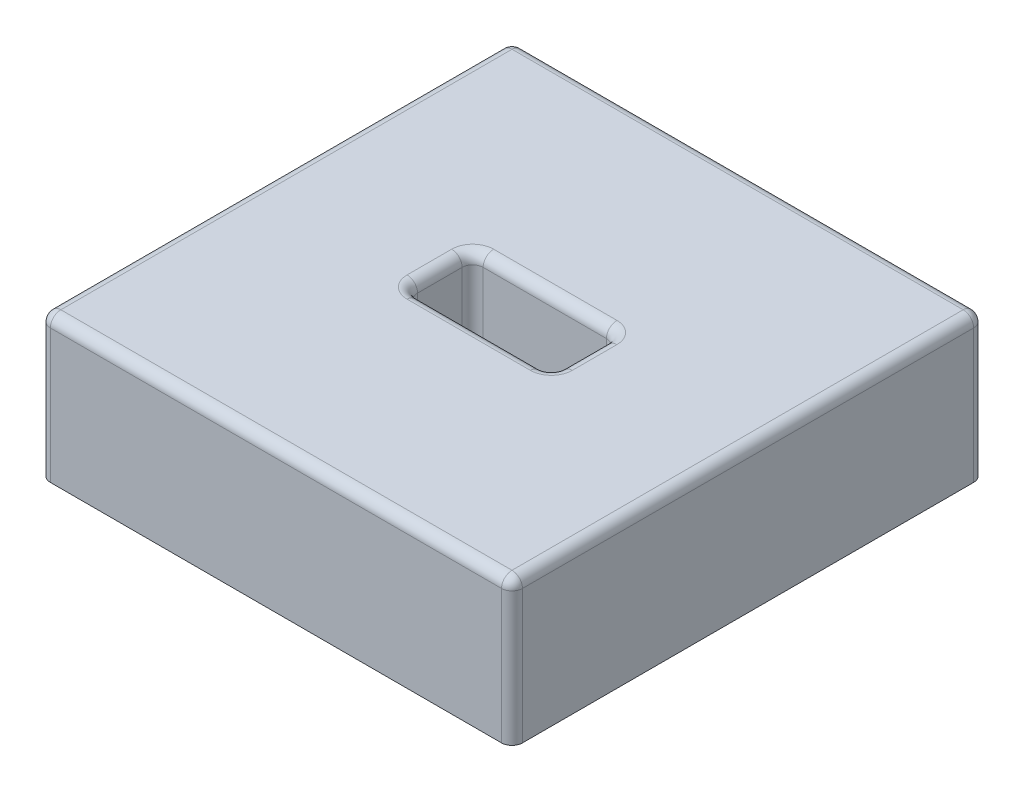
ISO-10303-21;
HEADER;
FILE_DESCRIPTION(('STEP AP214'),'2;1');
FILE_NAME('part.step','',(''),(''),'','','');
FILE_SCHEMA(('AUTOMOTIVE_DESIGN { 1 0 10303 214 1 1 1 1 }'));
ENDSEC;
DATA;
#1=APPLICATION_CONTEXT('core data for automotive mechanical design processes');
#2=APPLICATION_PROTOCOL_DEFINITION('international standard','automotive_design',2000,#1);
#3=PRODUCT_CONTEXT('',#1,'mechanical');
#4=PRODUCT('Part','Part','',(#3));
#5=PRODUCT_RELATED_PRODUCT_CATEGORY('part','',(#4));
#6=PRODUCT_DEFINITION_FORMATION('','',#4);
#7=PRODUCT_DEFINITION_CONTEXT('part definition',#1,'design');
#8=PRODUCT_DEFINITION('design','',#6,#7);
#9=PRODUCT_DEFINITION_SHAPE('','',#8);
#10=(LENGTH_UNIT() NAMED_UNIT(*) SI_UNIT(.MILLI.,.METRE.));
#11=(NAMED_UNIT(*) PLANE_ANGLE_UNIT() SI_UNIT($,.RADIAN.));
#12=(NAMED_UNIT(*) SI_UNIT($,.STERADIAN.) SOLID_ANGLE_UNIT());
#13=UNCERTAINTY_MEASURE_WITH_UNIT(LENGTH_MEASURE(1.E-05),#10,'distance_accuracy_value','');
#14=(GEOMETRIC_REPRESENTATION_CONTEXT(3) GLOBAL_UNCERTAINTY_ASSIGNED_CONTEXT((#13)) GLOBAL_UNIT_ASSIGNED_CONTEXT((#10,
#11,#12)) REPRESENTATION_CONTEXT('',''));
#15=CARTESIAN_POINT('',(0.,0.,0.));
#16=DIRECTION('',(0.,0.,1.));
#17=DIRECTION('',(1.,0.,0.));
#18=AXIS2_PLACEMENT_3D('',#15,#16,#17);
#19=CARTESIAN_POINT('',(0.,39.,0.));
#20=DIRECTION('',(0.,1.,0.));
#21=DIRECTION('',(0.,0.,1.));
#22=AXIS2_PLACEMENT_3D('',#19,#20,#21);
#23=PLANE('',#22);
#24=DIRECTION('',(0.,0.,-1.));
#25=VECTOR('',#24,1.);
#26=CARTESIAN_POINT('',(-35.,39.,-20.));
#27=LINE('',#26,#25);
#28=CARTESIAN_POINT('',(-35.,39.,-15.));
#29=VERTEX_POINT('',#28);
#30=CARTESIAN_POINT('',(-35.,39.,-20.));
#31=VERTEX_POINT('',#30);
#32=EDGE_CURVE('E514',#29,#31,#27,.T.);
#33=ORIENTED_EDGE('',*,*,#32,.F.);
#34=DIRECTION('',(-1.,0.,0.));
#35=VECTOR('',#34,1.);
#36=CARTESIAN_POINT('',(-86.,39.,-15.));
#37=LINE('',#36,#35);
#38=CARTESIAN_POINT('',(-86.,39.,-15.));
#39=VERTEX_POINT('',#38);
#40=EDGE_CURVE('E659',#29,#39,#37,.T.);
#41=ORIENTED_EDGE('',*,*,#40,.T.);
#42=DIRECTION('',(0.,0.,-1.));
#43=VECTOR('',#42,1.);
#44=CARTESIAN_POINT('',(-86.,39.,-15.));
#45=LINE('',#44,#43);
#46=CARTESIAN_POINT('',(-86.,39.,-20.));
#47=VERTEX_POINT('',#46);
#48=EDGE_CURVE('E644',#39,#47,#45,.T.);
#49=ORIENTED_EDGE('',*,*,#48,.T.);
#50=DIRECTION('',(-1.,0.,0.));
#51=VECTOR('',#50,1.);
#52=CARTESIAN_POINT('',(35.,39.,-20.));
#53=LINE('',#52,#51);
#54=EDGE_CURVE('E805',#31,#47,#53,.T.);
#55=ORIENTED_EDGE('',*,*,#54,.F.);
#56=EDGE_LOOP('',(#33,#41,#49,#55));
#57=FACE_BOUND('',#56,.T.);
#58=ADVANCED_FACE('F38',(#57),#23,.F.);
#59=DIRECTION('',(1.,0.,0.));
#60=VECTOR('',#59,1.);
#61=CARTESIAN_POINT('',(35.,39.,-20.));
#62=LINE('',#61,#60);
#63=CARTESIAN_POINT('',(-30.,39.,-20.));
#64=VERTEX_POINT('',#63);
#65=EDGE_CURVE('E529',#31,#64,#62,.T.);
#66=ORIENTED_EDGE('',*,*,#65,.F.);
#67=DIRECTION('',(0.,0.,-1.));
#68=VECTOR('',#67,1.);
#69=CARTESIAN_POINT('',(-35.,39.,86.));
#70=LINE('',#69,#68);
#71=CARTESIAN_POINT('',(-35.,39.,-86.));
#72=VERTEX_POINT('',#71);
#73=EDGE_CURVE('E638',#31,#72,#70,.T.);
#74=ORIENTED_EDGE('',*,*,#73,.T.);
#75=DIRECTION('',(1.,0.,0.));
#76=VECTOR('',#75,1.);
#77=CARTESIAN_POINT('',(-35.,39.,-86.));
#78=LINE('',#77,#76);
#79=CARTESIAN_POINT('',(-30.,39.,-86.));
#80=VERTEX_POINT('',#79);
#81=EDGE_CURVE('E634',#72,#80,#78,.T.);
#82=ORIENTED_EDGE('',*,*,#81,.T.);
#83=DIRECTION('',(0.,0.,1.));
#84=VECTOR('',#83,1.);
#85=CARTESIAN_POINT('',(-30.,39.,86.));
#86=LINE('',#85,#84);
#87=EDGE_CURVE('E631',#80,#64,#86,.T.);
#88=ORIENTED_EDGE('',*,*,#87,.T.);
#89=EDGE_LOOP('',(#66,#74,#82,#88));
#90=FACE_BOUND('',#89,.T.);
#91=ADVANCED_FACE('F1141',(#90),#23,.F.);
#92=CARTESIAN_POINT('',(30.,39.,-20.));
#93=VERTEX_POINT('',#92);
#94=CARTESIAN_POINT('',(35.,39.,-20.));
#95=VERTEX_POINT('',#94);
#96=EDGE_CURVE('E528',#93,#95,#62,.T.);
#97=ORIENTED_EDGE('',*,*,#96,.F.);
#98=DIRECTION('',(0.,0.,-1.));
#99=VECTOR('',#98,1.);
#100=CARTESIAN_POINT('',(30.,39.,86.));
#101=LINE('',#100,#99);
#102=CARTESIAN_POINT('',(30.,39.,-86.));
#103=VERTEX_POINT('',#102);
#104=EDGE_CURVE('E588',#93,#103,#101,.T.);
#105=ORIENTED_EDGE('',*,*,#104,.T.);
#106=DIRECTION('',(1.,0.,0.));
#107=VECTOR('',#106,1.);
#108=CARTESIAN_POINT('',(30.,39.,-86.));
#109=LINE('',#108,#107);
#110=CARTESIAN_POINT('',(35.,39.,-86.));
#111=VERTEX_POINT('',#110);
#112=EDGE_CURVE('E584',#103,#111,#109,.T.);
#113=ORIENTED_EDGE('',*,*,#112,.T.);
#114=DIRECTION('',(0.,0.,1.));
#115=VECTOR('',#114,1.);
#116=CARTESIAN_POINT('',(35.,39.,86.));
#117=LINE('',#116,#115);
#118=EDGE_CURVE('E581',#111,#95,#117,.T.);
#119=ORIENTED_EDGE('',*,*,#118,.T.);
#120=EDGE_LOOP('',(#97,#105,#113,#119));
#121=FACE_BOUND('',#120,.T.);
#122=ADVANCED_FACE('F1148',(#121),#23,.F.);
#123=DIRECTION('',(0.,0.,1.));
#124=VECTOR('',#123,1.);
#125=CARTESIAN_POINT('',(35.,39.,-20.));
#126=LINE('',#125,#124);
#127=CARTESIAN_POINT('',(35.,39.,-15.));
#128=VERTEX_POINT('',#127);
#129=EDGE_CURVE('E532',#95,#128,#126,.T.);
#130=ORIENTED_EDGE('',*,*,#129,.F.);
#131=CARTESIAN_POINT('',(86.,39.,-20.));
#132=VERTEX_POINT('',#131);
#133=EDGE_CURVE('E806',#132,#95,#53,.T.);
#134=ORIENTED_EDGE('',*,*,#133,.F.);
#135=DIRECTION('',(0.,0.,1.));
#136=VECTOR('',#135,1.);
#137=CARTESIAN_POINT('',(86.,39.,-15.));
#138=LINE('',#137,#136);
#139=CARTESIAN_POINT('',(86.,39.,-15.));
#140=VERTEX_POINT('',#139);
#141=EDGE_CURVE('E652',#132,#140,#138,.T.);
#142=ORIENTED_EDGE('',*,*,#141,.T.);
#143=DIRECTION('',(-1.,0.,0.));
#144=VECTOR('',#143,1.);
#145=CARTESIAN_POINT('',(-86.,39.,-15.));
#146=LINE('',#145,#144);
#147=EDGE_CURVE('E665',#140,#128,#146,.T.);
#148=ORIENTED_EDGE('',*,*,#147,.T.);
#149=EDGE_LOOP('',(#130,#134,#142,#148));
#150=FACE_BOUND('',#149,.T.);
#151=ADVANCED_FACE('F1777',(#150),#23,.F.);
#152=CARTESIAN_POINT('',(35.,39.,15.));
#153=VERTEX_POINT('',#152);
#154=CARTESIAN_POINT('',(35.,39.,20.));
#155=VERTEX_POINT('',#154);
#156=EDGE_CURVE('E531',#153,#155,#126,.T.);
#157=ORIENTED_EDGE('',*,*,#156,.F.);
#158=DIRECTION('',(1.,0.,0.));
#159=VECTOR('',#158,1.);
#160=CARTESIAN_POINT('',(-86.,39.,15.));
#161=LINE('',#160,#159);
#162=CARTESIAN_POINT('',(86.,39.,15.));
#163=VERTEX_POINT('',#162);
#164=EDGE_CURVE('E685',#153,#163,#161,.T.);
#165=ORIENTED_EDGE('',*,*,#164,.T.);
#166=DIRECTION('',(0.,0.,1.));
#167=VECTOR('',#166,1.);
#168=CARTESIAN_POINT('',(86.,39.,20.));
#169=LINE('',#168,#167);
#170=CARTESIAN_POINT('',(86.,39.,20.));
#171=VERTEX_POINT('',#170);
#172=EDGE_CURVE('E702',#163,#171,#169,.T.);
#173=ORIENTED_EDGE('',*,*,#172,.T.);
#174=DIRECTION('',(1.,0.,0.));
#175=VECTOR('',#174,1.);
#176=CARTESIAN_POINT('',(35.,39.,20.));
#177=LINE('',#176,#175);
#178=EDGE_CURVE('E796',#155,#171,#177,.T.);
#179=ORIENTED_EDGE('',*,*,#178,.F.);
#180=EDGE_LOOP('',(#157,#165,#173,#179));
#181=FACE_BOUND('',#180,.T.);
#182=ADVANCED_FACE('F1251',(#181),#23,.F.);
#183=DIRECTION('',(-1.,0.,0.));
#184=VECTOR('',#183,1.);
#185=CARTESIAN_POINT('',(35.,39.,20.));
#186=LINE('',#185,#184);
#187=CARTESIAN_POINT('',(30.,39.,20.));
#188=VERTEX_POINT('',#187);
#189=EDGE_CURVE('E519',#155,#188,#186,.T.);
#190=ORIENTED_EDGE('',*,*,#189,.F.);
#191=DIRECTION('',(0.,0.,1.));
#192=VECTOR('',#191,1.);
#193=CARTESIAN_POINT('',(35.,39.,86.));
#194=LINE('',#193,#192);
#195=CARTESIAN_POINT('',(35.,39.,86.));
#196=VERTEX_POINT('',#195);
#197=EDGE_CURVE('E555',#155,#196,#194,.T.);
#198=ORIENTED_EDGE('',*,*,#197,.T.);
#199=DIRECTION('',(-1.,0.,0.));
#200=VECTOR('',#199,1.);
#201=CARTESIAN_POINT('',(30.,39.,86.));
#202=LINE('',#201,#200);
#203=CARTESIAN_POINT('',(30.,39.,86.));
#204=VERTEX_POINT('',#203);
#205=EDGE_CURVE('E558',#196,#204,#202,.T.);
#206=ORIENTED_EDGE('',*,*,#205,.T.);
#207=DIRECTION('',(0.,0.,-1.));
#208=VECTOR('',#207,1.);
#209=CARTESIAN_POINT('',(30.,39.,86.));
#210=LINE('',#209,#208);
#211=EDGE_CURVE('E547',#204,#188,#210,.T.);
#212=ORIENTED_EDGE('',*,*,#211,.T.);
#213=EDGE_LOOP('',(#190,#198,#206,#212));
#214=FACE_BOUND('',#213,.T.);
#215=ADVANCED_FACE('F1165',(#214),#23,.F.);
#216=CARTESIAN_POINT('',(-35.,39.,20.));
#217=VERTEX_POINT('',#216);
#218=CARTESIAN_POINT('',(-35.,39.,15.));
#219=VERTEX_POINT('',#218);
#220=EDGE_CURVE('E526',#217,#219,#27,.T.);
#221=ORIENTED_EDGE('',*,*,#220,.F.);
#222=CARTESIAN_POINT('',(-86.,39.,20.));
#223=VERTEX_POINT('',#222);
#224=EDGE_CURVE('E802',#223,#217,#177,.T.);
#225=ORIENTED_EDGE('',*,*,#224,.F.);
#226=DIRECTION('',(0.,0.,-1.));
#227=VECTOR('',#226,1.);
#228=CARTESIAN_POINT('',(-86.,39.,20.));
#229=LINE('',#228,#227);
#230=CARTESIAN_POINT('',(-86.,39.,15.));
#231=VERTEX_POINT('',#230);
#232=EDGE_CURVE('E681',#223,#231,#229,.T.);
#233=ORIENTED_EDGE('',*,*,#232,.T.);
#234=DIRECTION('',(1.,0.,0.));
#235=VECTOR('',#234,1.);
#236=CARTESIAN_POINT('',(-86.,39.,15.));
#237=LINE('',#236,#235);
#238=EDGE_CURVE('E693',#231,#219,#237,.T.);
#239=ORIENTED_EDGE('',*,*,#238,.T.);
#240=EDGE_LOOP('',(#221,#225,#233,#239));
#241=FACE_BOUND('',#240,.T.);
#242=ADVANCED_FACE('F1154',(#241),#23,.F.);
#243=CARTESIAN_POINT('',(-30.,39.,20.));
#244=VERTEX_POINT('',#243);
#245=EDGE_CURVE('E534',#244,#217,#186,.T.);
#246=ORIENTED_EDGE('',*,*,#245,.F.);
#247=DIRECTION('',(0.,0.,1.));
#248=VECTOR('',#247,1.);
#249=CARTESIAN_POINT('',(-30.,39.,86.));
#250=LINE('',#249,#248);
#251=CARTESIAN_POINT('',(-30.,39.,86.));
#252=VERTEX_POINT('',#251);
#253=EDGE_CURVE('E605',#244,#252,#250,.T.);
#254=ORIENTED_EDGE('',*,*,#253,.T.);
#255=DIRECTION('',(-1.,0.,0.));
#256=VECTOR('',#255,1.);
#257=CARTESIAN_POINT('',(-35.,39.,86.));
#258=LINE('',#257,#256);
#259=CARTESIAN_POINT('',(-35.,39.,86.));
#260=VERTEX_POINT('',#259);
#261=EDGE_CURVE('E608',#252,#260,#258,.T.);
#262=ORIENTED_EDGE('',*,*,#261,.T.);
#263=DIRECTION('',(0.,0.,-1.));
#264=VECTOR('',#263,1.);
#265=CARTESIAN_POINT('',(-35.,39.,86.));
#266=LINE('',#265,#264);
#267=EDGE_CURVE('E594',#260,#217,#266,.T.);
#268=ORIENTED_EDGE('',*,*,#267,.T.);
#269=EDGE_LOOP('',(#246,#254,#262,#268));
#270=FACE_BOUND('',#269,.T.);
#271=ADVANCED_FACE('F1144',(#270),#23,.F.);
#272=CARTESIAN_POINT('',(0.,55.,0.));
#273=DIRECTION('',(0.,1.,0.));
#274=DIRECTION('',(0.,0.,1.));
#275=AXIS2_PLACEMENT_3D('',#272,#273,#274);
#276=PLANE('',#275);
#277=DIRECTION('',(1.,0.,0.));
#278=VECTOR('',#277,1.);
#279=CARTESIAN_POINT('',(90.,55.,86.));
#280=LINE('',#279,#278);
#281=CARTESIAN_POINT('',(35.,55.,86.));
#282=VERTEX_POINT('',#281);
#283=CARTESIAN_POINT('',(73.2917960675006,55.,86.));
#284=VERTEX_POINT('',#283);
#285=EDGE_CURVE('E817',#282,#284,#280,.T.);
#286=ORIENTED_EDGE('',*,*,#285,.F.);
#287=DIRECTION('',(0.,0.,1.));
#288=VECTOR('',#287,1.);
#289=CARTESIAN_POINT('',(35.,55.,86.));
#290=LINE('',#289,#288);
#291=CARTESIAN_POINT('',(35.,55.,20.));
#292=VERTEX_POINT('',#291);
#293=EDGE_CURVE('E566',#292,#282,#290,.T.);
#294=ORIENTED_EDGE('',*,*,#293,.F.);
#295=DIRECTION('',(1.,0.,0.));
#296=VECTOR('',#295,1.);
#297=CARTESIAN_POINT('',(0.,55.,20.));
#298=LINE('',#297,#296);
#299=CARTESIAN_POINT('',(86.,55.,20.));
#300=VERTEX_POINT('',#299);
#301=EDGE_CURVE('E861',#292,#300,#298,.T.);
#302=ORIENTED_EDGE('',*,*,#301,.T.);
#303=DIRECTION('',(0.,0.,-1.));
#304=VECTOR('',#303,1.);
#305=CARTESIAN_POINT('',(86.,55.,90.));
#306=LINE('',#305,#304);
#307=CARTESIAN_POINT('',(86.,55.,73.2917960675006));
#308=VERTEX_POINT('',#307);
#309=EDGE_CURVE('E831',#308,#300,#306,.T.);
#310=ORIENTED_EDGE('',*,*,#309,.F.);
#311=CARTESIAN_POINT('',(80.,55.,80.));
#312=DIRECTION('',(0.,1.,0.));
#313=DIRECTION('',(0.,0.,1.));
#314=AXIS2_PLACEMENT_3D('',#311,#312,#313);
#315=CIRCLE('',#314,8.99999999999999);
#316=EDGE_CURVE('E772',#308,#284,#315,.T.);
#317=ORIENTED_EDGE('',*,*,#316,.T.);
#318=EDGE_LOOP('',(#286,#294,#302,#310,#317));
#319=FACE_BOUND('',#318,.T.);
#320=ADVANCED_FACE('F1153',(#319),#276,.F.);
#321=CARTESIAN_POINT('',(35.,39.,20.));
#322=DIRECTION('',(0.,0.,1.));
#323=DIRECTION('',(1.,0.,0.));
#324=AXIS2_PLACEMENT_3D('',#321,#322,#323);
#325=PLANE('',#324);
#326=DIRECTION('',(0.,-1.,0.));
#327=VECTOR('',#326,1.);
#328=CARTESIAN_POINT('',(35.,59.002,20.));
#329=LINE('',#328,#327);
#330=EDGE_CURVE('E548',#292,#155,#329,.T.);
#331=ORIENTED_EDGE('',*,*,#330,.T.);
#332=ORIENTED_EDGE('',*,*,#178,.T.);
#333=DIRECTION('',(0.,-1.,0.));
#334=VECTOR('',#333,1.);
#335=CARTESIAN_POINT('',(86.,59.002,20.));
#336=LINE('',#335,#334);
#337=EDGE_CURVE('E705',#300,#171,#336,.T.);
#338=ORIENTED_EDGE('',*,*,#337,.F.);
#339=ORIENTED_EDGE('',*,*,#301,.F.);
#340=EDGE_LOOP('',(#331,#332,#338,#339));
#341=FACE_BOUND('',#340,.T.);
#342=ADVANCED_FACE('F1160',(#341),#325,.T.);
#343=DIRECTION('',(-1.,0.,0.));
#344=VECTOR('',#343,1.);
#345=CARTESIAN_POINT('',(0.,55.,-20.));
#346=LINE('',#345,#344);
#347=CARTESIAN_POINT('',(86.,55.,-20.));
#348=VERTEX_POINT('',#347);
#349=CARTESIAN_POINT('',(35.,55.,-20.));
#350=VERTEX_POINT('',#349);
#351=EDGE_CURVE('E870',#348,#350,#346,.T.);
#352=ORIENTED_EDGE('',*,*,#351,.T.);
#353=DIRECTION('',(0.,0.,1.));
#354=VECTOR('',#353,1.);
#355=CARTESIAN_POINT('',(35.,55.,86.));
#356=LINE('',#355,#354);
#357=CARTESIAN_POINT('',(35.,55.,-86.));
#358=VERTEX_POINT('',#357);
#359=EDGE_CURVE('E576',#358,#350,#356,.T.);
#360=ORIENTED_EDGE('',*,*,#359,.F.);
#361=DIRECTION('',(-1.,0.,0.));
#362=VECTOR('',#361,1.);
#363=CARTESIAN_POINT('',(90.,55.,-86.));
#364=LINE('',#363,#362);
#365=CARTESIAN_POINT('',(73.2917960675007,55.,-86.));
#366=VERTEX_POINT('',#365);
#367=EDGE_CURVE('E823',#366,#358,#364,.T.);
#368=ORIENTED_EDGE('',*,*,#367,.F.);
#369=CARTESIAN_POINT('',(80.,55.,-80.));
#370=DIRECTION('',(0.,1.,0.));
#371=DIRECTION('',(0.,0.,1.));
#372=AXIS2_PLACEMENT_3D('',#369,#370,#371);
#373=CIRCLE('',#372,8.99999999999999);
#374=CARTESIAN_POINT('',(86.,55.,-73.2917960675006));
#375=VERTEX_POINT('',#374);
#376=EDGE_CURVE('E736',#366,#375,#373,.T.);
#377=ORIENTED_EDGE('',*,*,#376,.T.);
#378=EDGE_CURVE('E828',#348,#375,#306,.T.);
#379=ORIENTED_EDGE('',*,*,#378,.F.);
#380=EDGE_LOOP('',(#352,#360,#368,#377,#379));
#381=FACE_BOUND('',#380,.T.);
#382=ADVANCED_FACE('F1163',(#381),#276,.F.);
#383=CARTESIAN_POINT('',(35.,39.,-20.));
#384=DIRECTION('',(0.,0.,-1.));
#385=DIRECTION('',(-1.,0.,0.));
#386=AXIS2_PLACEMENT_3D('',#383,#384,#385);
#387=PLANE('',#386);
#388=DIRECTION('',(0.,1.,0.));
#389=VECTOR('',#388,1.);
#390=CARTESIAN_POINT('',(35.,59.002,-20.));
#391=LINE('',#390,#389);
#392=EDGE_CURVE('E551',#95,#350,#391,.T.);
#393=ORIENTED_EDGE('',*,*,#392,.T.);
#394=ORIENTED_EDGE('',*,*,#351,.F.);
#395=DIRECTION('',(0.,-1.,0.));
#396=VECTOR('',#395,1.);
#397=CARTESIAN_POINT('',(86.,59.002,-20.));
#398=LINE('',#397,#396);
#399=EDGE_CURVE('E671',#348,#132,#398,.T.);
#400=ORIENTED_EDGE('',*,*,#399,.T.);
#401=ORIENTED_EDGE('',*,*,#133,.T.);
#402=EDGE_LOOP('',(#393,#394,#400,#401));
#403=FACE_BOUND('',#402,.T.);
#404=ADVANCED_FACE('F1692',(#403),#387,.T.);
#405=CARTESIAN_POINT('',(-30.,55.,20.));
#406=VERTEX_POINT('',#405);
#407=CARTESIAN_POINT('',(30.,55.,20.));
#408=VERTEX_POINT('',#407);
#409=EDGE_CURVE('E866',#406,#408,#298,.T.);
#410=ORIENTED_EDGE('',*,*,#409,.T.);
#411=DIRECTION('',(0.,0.,-1.));
#412=VECTOR('',#411,1.);
#413=CARTESIAN_POINT('',(30.,55.,86.));
#414=LINE('',#413,#412);
#415=CARTESIAN_POINT('',(30.,55.,86.));
#416=VERTEX_POINT('',#415);
#417=EDGE_CURVE('E554',#416,#408,#414,.T.);
#418=ORIENTED_EDGE('',*,*,#417,.F.);
#419=CARTESIAN_POINT('',(-30.,55.,86.));
#420=VERTEX_POINT('',#419);
#421=EDGE_CURVE('E829',#420,#416,#280,.T.);
#422=ORIENTED_EDGE('',*,*,#421,.F.);
#423=DIRECTION('',(0.,0.,1.));
#424=VECTOR('',#423,1.);
#425=CARTESIAN_POINT('',(-30.,55.,86.));
#426=LINE('',#425,#424);
#427=EDGE_CURVE('E616',#406,#420,#426,.T.);
#428=ORIENTED_EDGE('',*,*,#427,.F.);
#429=EDGE_LOOP('',(#410,#418,#422,#428));
#430=FACE_BOUND('',#429,.T.);
#431=ADVANCED_FACE('F1183',(#430),#276,.F.);
#432=DIRECTION('',(0.,1.,0.));
#433=VECTOR('',#432,1.);
#434=CARTESIAN_POINT('',(30.,59.002,20.));
#435=LINE('',#434,#433);
#436=EDGE_CURVE('E552',#188,#408,#435,.T.);
#437=ORIENTED_EDGE('',*,*,#436,.T.);
#438=ORIENTED_EDGE('',*,*,#409,.F.);
#439=DIRECTION('',(0.,-1.,0.));
#440=VECTOR('',#439,1.);
#441=CARTESIAN_POINT('',(-30.,59.002,20.));
#442=LINE('',#441,#440);
#443=EDGE_CURVE('E598',#406,#244,#442,.T.);
#444=ORIENTED_EDGE('',*,*,#443,.T.);
#445=ORIENTED_EDGE('',*,*,#245,.T.);
#446=DIRECTION('',(0.,1.,0.));
#447=VECTOR('',#446,1.);
#448=CARTESIAN_POINT('',(-35.,24.,20.));
#449=LINE('',#448,#447);
#450=CARTESIAN_POINT('',(-35.,24.,20.));
#451=VERTEX_POINT('',#450);
#452=EDGE_CURVE('E525',#451,#217,#449,.T.);
#453=ORIENTED_EDGE('',*,*,#452,.F.);
#454=DIRECTION('',(-1.,0.,0.));
#455=VECTOR('',#454,1.);
#456=CARTESIAN_POINT('',(35.,24.,20.));
#457=LINE('',#456,#455);
#458=CARTESIAN_POINT('',(35.,24.,20.));
#459=VERTEX_POINT('',#458);
#460=EDGE_CURVE('E523',#459,#451,#457,.T.);
#461=ORIENTED_EDGE('',*,*,#460,.F.);
#462=DIRECTION('',(0.,1.,0.));
#463=VECTOR('',#462,1.);
#464=CARTESIAN_POINT('',(35.,24.,20.));
#465=LINE('',#464,#463);
#466=EDGE_CURVE('E538',#459,#155,#465,.T.);
#467=ORIENTED_EDGE('',*,*,#466,.T.);
#468=ORIENTED_EDGE('',*,*,#189,.T.);
#469=EDGE_LOOP('',(#437,#438,#444,#445,#453,#461,#467,#468));
#470=FACE_BOUND('',#469,.T.);
#471=ADVANCED_FACE('F1173',(#470),#325,.T.);
#472=CARTESIAN_POINT('',(30.,55.,-86.));
#473=VERTEX_POINT('',#472);
#474=CARTESIAN_POINT('',(-30.,55.,-86.));
#475=VERTEX_POINT('',#474);
#476=EDGE_CURVE('E838',#473,#475,#364,.T.);
#477=ORIENTED_EDGE('',*,*,#476,.F.);
#478=DIRECTION('',(0.,0.,-1.));
#479=VECTOR('',#478,1.);
#480=CARTESIAN_POINT('',(30.,55.,86.));
#481=LINE('',#480,#479);
#482=CARTESIAN_POINT('',(30.,55.,-20.));
#483=VERTEX_POINT('',#482);
#484=EDGE_CURVE('E573',#483,#473,#481,.T.);
#485=ORIENTED_EDGE('',*,*,#484,.F.);
#486=CARTESIAN_POINT('',(-30.,55.,-20.));
#487=VERTEX_POINT('',#486);
#488=EDGE_CURVE('E874',#483,#487,#346,.T.);
#489=ORIENTED_EDGE('',*,*,#488,.T.);
#490=DIRECTION('',(0.,0.,1.));
#491=VECTOR('',#490,1.);
#492=CARTESIAN_POINT('',(-30.,55.,86.));
#493=LINE('',#492,#491);
#494=EDGE_CURVE('E626',#475,#487,#493,.T.);
#495=ORIENTED_EDGE('',*,*,#494,.F.);
#496=EDGE_LOOP('',(#477,#485,#489,#495));
#497=FACE_BOUND('',#496,.T.);
#498=ADVANCED_FACE('F1711',(#497),#276,.F.);
#499=DIRECTION('',(0.,-1.,0.));
#500=VECTOR('',#499,1.);
#501=CARTESIAN_POINT('',(30.,59.002,-20.));
#502=LINE('',#501,#500);
#503=EDGE_CURVE('E577',#483,#93,#502,.T.);
#504=ORIENTED_EDGE('',*,*,#503,.T.);
#505=ORIENTED_EDGE('',*,*,#96,.T.);
#506=DIRECTION('',(0.,1.,0.));
#507=VECTOR('',#506,1.);
#508=CARTESIAN_POINT('',(35.,24.,-20.));
#509=LINE('',#508,#507);
#510=CARTESIAN_POINT('',(35.,24.,-20.));
#511=VERTEX_POINT('',#510);
#512=EDGE_CURVE('E541',#511,#95,#509,.T.);
#513=ORIENTED_EDGE('',*,*,#512,.F.);
#514=DIRECTION('',(1.,0.,0.));
#515=VECTOR('',#514,1.);
#516=CARTESIAN_POINT('',(35.,24.,-20.));
#517=LINE('',#516,#515);
#518=CARTESIAN_POINT('',(-35.,24.,-20.));
#519=VERTEX_POINT('',#518);
#520=EDGE_CURVE('E518',#519,#511,#517,.T.);
#521=ORIENTED_EDGE('',*,*,#520,.F.);
#522=DIRECTION('',(0.,1.,0.));
#523=VECTOR('',#522,1.);
#524=CARTESIAN_POINT('',(-35.,24.,-20.));
#525=LINE('',#524,#523);
#526=EDGE_CURVE('E544',#519,#31,#525,.T.);
#527=ORIENTED_EDGE('',*,*,#526,.T.);
#528=ORIENTED_EDGE('',*,*,#65,.T.);
#529=DIRECTION('',(0.,1.,0.));
#530=VECTOR('',#529,1.);
#531=CARTESIAN_POINT('',(-30.,59.002,-20.));
#532=LINE('',#531,#530);
#533=EDGE_CURVE('E601',#64,#487,#532,.T.);
#534=ORIENTED_EDGE('',*,*,#533,.T.);
#535=ORIENTED_EDGE('',*,*,#488,.F.);
#536=EDGE_LOOP('',(#504,#505,#513,#521,#527,#528,#534,#535));
#537=FACE_BOUND('',#536,.T.);
#538=ADVANCED_FACE('F1693',(#537),#387,.T.);
#539=CARTESIAN_POINT('',(-35.,55.,-86.));
#540=VERTEX_POINT('',#539);
#541=CARTESIAN_POINT('',(-73.2917960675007,55.,-86.));
#542=VERTEX_POINT('',#541);
#543=EDGE_CURVE('E834',#540,#542,#364,.T.);
#544=ORIENTED_EDGE('',*,*,#543,.F.);
#545=DIRECTION('',(0.,0.,-1.));
#546=VECTOR('',#545,1.);
#547=CARTESIAN_POINT('',(-35.,55.,86.));
#548=LINE('',#547,#546);
#549=CARTESIAN_POINT('',(-35.,55.,-20.));
#550=VERTEX_POINT('',#549);
#551=EDGE_CURVE('E623',#550,#540,#548,.T.);
#552=ORIENTED_EDGE('',*,*,#551,.F.);
#553=CARTESIAN_POINT('',(-86.,55.,-20.));
#554=VERTEX_POINT('',#553);
#555=EDGE_CURVE('E869',#550,#554,#346,.T.);
#556=ORIENTED_EDGE('',*,*,#555,.T.);
#557=DIRECTION('',(0.,0.,1.));
#558=VECTOR('',#557,1.);
#559=CARTESIAN_POINT('',(-86.,55.,90.));
#560=LINE('',#559,#558);
#561=CARTESIAN_POINT('',(-86.,55.,-73.2917960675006));
#562=VERTEX_POINT('',#561);
#563=EDGE_CURVE('E814',#562,#554,#560,.T.);
#564=ORIENTED_EDGE('',*,*,#563,.F.);
#565=CARTESIAN_POINT('',(-80.,55.,-80.));
#566=DIRECTION('',(0.,1.,0.));
#567=DIRECTION('',(0.,0.,1.));
#568=AXIS2_PLACEMENT_3D('',#565,#566,#567);
#569=CIRCLE('',#568,8.99999999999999);
#570=EDGE_CURVE('E754',#562,#542,#569,.T.);
#571=ORIENTED_EDGE('',*,*,#570,.T.);
#572=EDGE_LOOP('',(#544,#552,#556,#564,#571));
#573=FACE_BOUND('',#572,.T.);
#574=ADVANCED_FACE('F1286',(#573),#276,.F.);
#575=DIRECTION('',(0.,0.,-1.));
#576=VECTOR('',#575,1.);
#577=CARTESIAN_POINT('',(35.,55.,0.));
#578=LINE('',#577,#576);
#579=CARTESIAN_POINT('',(35.,55.,15.));
#580=VERTEX_POINT('',#579);
#581=CARTESIAN_POINT('',(35.,55.,-15.));
#582=VERTEX_POINT('',#581);
#583=EDGE_CURVE('E865',#580,#582,#578,.T.);
#584=ORIENTED_EDGE('',*,*,#583,.T.);
#585=DIRECTION('',(-1.,0.,0.));
#586=VECTOR('',#585,1.);
#587=CARTESIAN_POINT('',(-86.,55.,-15.));
#588=LINE('',#587,#586);
#589=CARTESIAN_POINT('',(86.,55.,-15.));
#590=VERTEX_POINT('',#589);
#591=EDGE_CURVE('E674',#590,#582,#588,.T.);
#592=ORIENTED_EDGE('',*,*,#591,.F.);
#593=CARTESIAN_POINT('',(86.,55.,15.));
#594=VERTEX_POINT('',#593);
#595=EDGE_CURVE('E835',#594,#590,#306,.T.);
#596=ORIENTED_EDGE('',*,*,#595,.F.);
#597=DIRECTION('',(1.,0.,0.));
#598=VECTOR('',#597,1.);
#599=CARTESIAN_POINT('',(-86.,55.,15.));
#600=LINE('',#599,#598);
#601=EDGE_CURVE('E708',#580,#594,#600,.T.);
#602=ORIENTED_EDGE('',*,*,#601,.F.);
#603=EDGE_LOOP('',(#584,#592,#596,#602));
#604=FACE_BOUND('',#603,.T.);
#605=ADVANCED_FACE('F1261',(#604),#276,.F.);
#606=CARTESIAN_POINT('',(-86.,55.,-15.));
#607=VERTEX_POINT('',#606);
#608=CARTESIAN_POINT('',(-86.,55.,15.));
#609=VERTEX_POINT('',#608);
#610=EDGE_CURVE('E818',#607,#609,#560,.T.);
#611=ORIENTED_EDGE('',*,*,#610,.F.);
#612=DIRECTION('',(-1.,0.,0.));
#613=VECTOR('',#612,1.);
#614=CARTESIAN_POINT('',(-86.,55.,-15.));
#615=LINE('',#614,#613);
#616=CARTESIAN_POINT('',(-35.,55.,-15.));
#617=VERTEX_POINT('',#616);
#618=EDGE_CURVE('E653',#617,#607,#615,.T.);
#619=ORIENTED_EDGE('',*,*,#618,.F.);
#620=DIRECTION('',(0.,0.,1.));
#621=VECTOR('',#620,1.);
#622=CARTESIAN_POINT('',(-35.,55.,0.));
#623=LINE('',#622,#621);
#624=CARTESIAN_POINT('',(-35.,55.,15.));
#625=VERTEX_POINT('',#624);
#626=EDGE_CURVE('E873',#617,#625,#623,.T.);
#627=ORIENTED_EDGE('',*,*,#626,.T.);
#628=DIRECTION('',(1.,0.,0.));
#629=VECTOR('',#628,1.);
#630=CARTESIAN_POINT('',(-86.,55.,15.));
#631=LINE('',#630,#629);
#632=EDGE_CURVE('E686',#609,#625,#631,.T.);
#633=ORIENTED_EDGE('',*,*,#632,.F.);
#634=EDGE_LOOP('',(#611,#619,#627,#633));
#635=FACE_BOUND('',#634,.T.);
#636=ADVANCED_FACE('F1233',(#635),#276,.F.);
#637=CARTESIAN_POINT('',(90.,59.,-86.));
#638=DIRECTION('',(0.,0.,1.));
#639=DIRECTION('',(1.,0.,0.));
#640=AXIS2_PLACEMENT_3D('',#637,#638,#639);
#641=PLANE('',#640);
#642=DIRECTION('',(0.,-1.,0.));
#643=VECTOR('',#642,1.);
#644=CARTESIAN_POINT('',(35.,59.002,-86.));
#645=LINE('',#644,#643);
#646=EDGE_CURVE('E585',#358,#111,#645,.T.);
#647=ORIENTED_EDGE('',*,*,#646,.T.);
#648=ORIENTED_EDGE('',*,*,#112,.F.);
#649=DIRECTION('',(0.,-1.,0.));
#650=VECTOR('',#649,1.);
#651=CARTESIAN_POINT('',(30.,59.002,-86.));
#652=LINE('',#651,#650);
#653=EDGE_CURVE('E580',#473,#103,#652,.T.);
#654=ORIENTED_EDGE('',*,*,#653,.F.);
#655=ORIENTED_EDGE('',*,*,#476,.T.);
#656=DIRECTION('',(0.,-1.,0.));
#657=VECTOR('',#656,1.);
#658=CARTESIAN_POINT('',(-30.,59.002,-86.));
#659=LINE('',#658,#657);
#660=EDGE_CURVE('E635',#475,#80,#659,.T.);
#661=ORIENTED_EDGE('',*,*,#660,.T.);
#662=ORIENTED_EDGE('',*,*,#81,.F.);
#663=DIRECTION('',(0.,-1.,0.));
#664=VECTOR('',#663,1.);
#665=CARTESIAN_POINT('',(-35.,59.002,-86.));
#666=LINE('',#665,#664);
#667=EDGE_CURVE('E630',#540,#72,#666,.T.);
#668=ORIENTED_EDGE('',*,*,#667,.F.);
#669=ORIENTED_EDGE('',*,*,#543,.T.);
#670=DIRECTION('',(0.,-1.,0.));
#671=VECTOR('',#670,1.);
#672=CARTESIAN_POINT('',(-73.2917960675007,59.002,-86.));
#673=LINE('',#672,#671);
#674=CARTESIAN_POINT('',(-73.2917960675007,24.5,-86.));
#675=VERTEX_POINT('',#674);
#676=EDGE_CURVE('E758',#675,#542,#673,.F.);
#677=ORIENTED_EDGE('',*,*,#676,.F.);
#678=DIRECTION('',(1.,0.,0.));
#679=VECTOR('',#678,1.);
#680=CARTESIAN_POINT('',(-80.,24.5,-86.));
#681=LINE('',#680,#679);
#682=CARTESIAN_POINT('',(-86.,24.5,-86.));
#683=VERTEX_POINT('',#682);
#684=EDGE_CURVE('E750',#683,#675,#681,.T.);
#685=ORIENTED_EDGE('',*,*,#684,.F.);
#686=DIRECTION('',(0.,-1.,0.));
#687=VECTOR('',#686,1.);
#688=CARTESIAN_POINT('',(-86.,59.,-86.));
#689=LINE('',#688,#687);
#690=CARTESIAN_POINT('',(-86.,4.,-86.));
#691=VERTEX_POINT('',#690);
#692=EDGE_CURVE('E820',#683,#691,#689,.T.);
#693=ORIENTED_EDGE('',*,*,#692,.T.);
#694=DIRECTION('',(-1.,0.,0.));
#695=VECTOR('',#694,1.);
#696=CARTESIAN_POINT('',(90.,4.,-86.));
#697=LINE('',#696,#695);
#698=CARTESIAN_POINT('',(86.,4.,-86.));
#699=VERTEX_POINT('',#698);
#700=EDGE_CURVE('E842',#699,#691,#697,.T.);
#701=ORIENTED_EDGE('',*,*,#700,.F.);
#702=DIRECTION('',(0.,-1.,0.));
#703=VECTOR('',#702,1.);
#704=CARTESIAN_POINT('',(86.,59.,-86.));
#705=LINE('',#704,#703);
#706=CARTESIAN_POINT('',(86.,24.5,-86.));
#707=VERTEX_POINT('',#706);
#708=EDGE_CURVE('E822',#707,#699,#705,.T.);
#709=ORIENTED_EDGE('',*,*,#708,.F.);
#710=DIRECTION('',(1.,0.,0.));
#711=VECTOR('',#710,1.);
#712=CARTESIAN_POINT('',(80.,24.5,-86.));
#713=LINE('',#712,#711);
#714=CARTESIAN_POINT('',(73.2917960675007,24.5,-86.));
#715=VERTEX_POINT('',#714);
#716=EDGE_CURVE('E732',#715,#707,#713,.T.);
#717=ORIENTED_EDGE('',*,*,#716,.F.);
#718=DIRECTION('',(0.,-1.,0.));
#719=VECTOR('',#718,1.);
#720=CARTESIAN_POINT('',(73.2917960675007,59.002,-86.));
#721=LINE('',#720,#719);
#722=EDGE_CURVE('E740',#366,#715,#721,.T.);
#723=ORIENTED_EDGE('',*,*,#722,.F.);
#724=ORIENTED_EDGE('',*,*,#367,.T.);
#725=EDGE_LOOP('',(#647,#648,#654,#655,#661,#662,#668,#669,#677,#685,#693,#701,#709,#717,#723,#724));
#726=FACE_BOUND('',#725,.T.);
#727=ADVANCED_FACE('F1274',(#726),#641,.T.);
#728=CARTESIAN_POINT('',(86.,59.,90.));
#729=DIRECTION('',(-1.,0.,0.));
#730=DIRECTION('',(0.,0.,1.));
#731=AXIS2_PLACEMENT_3D('',#728,#729,#730);
#732=PLANE('',#731);
#733=DIRECTION('',(0.,-1.,0.));
#734=VECTOR('',#733,1.);
#735=CARTESIAN_POINT('',(86.,59.002,-15.));
#736=LINE('',#735,#734);
#737=EDGE_CURVE('E668',#590,#140,#736,.T.);
#738=ORIENTED_EDGE('',*,*,#737,.T.);
#739=ORIENTED_EDGE('',*,*,#141,.F.);
#740=ORIENTED_EDGE('',*,*,#399,.F.);
#741=ORIENTED_EDGE('',*,*,#378,.T.);
#742=DIRECTION('',(0.,-1.,0.));
#743=VECTOR('',#742,1.);
#744=CARTESIAN_POINT('',(86.,59.002,-73.2917960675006));
#745=LINE('',#744,#743);
#746=CARTESIAN_POINT('',(86.,24.5,-73.2917960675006));
#747=VERTEX_POINT('',#746);
#748=EDGE_CURVE('E735',#747,#375,#745,.F.);
#749=ORIENTED_EDGE('',*,*,#748,.F.);
#750=DIRECTION('',(0.,0.,1.));
#751=VECTOR('',#750,1.);
#752=CARTESIAN_POINT('',(86.,24.5,-80.));
#753=LINE('',#752,#751);
#754=EDGE_CURVE('E729',#707,#747,#753,.T.);
#755=ORIENTED_EDGE('',*,*,#754,.F.);
#756=ORIENTED_EDGE('',*,*,#708,.T.);
#757=DIRECTION('',(0.,0.,-1.));
#758=VECTOR('',#757,1.);
#759=CARTESIAN_POINT('',(86.,4.,90.));
#760=LINE('',#759,#758);
#761=CARTESIAN_POINT('',(86.,4.,86.));
#762=VERTEX_POINT('',#761);
#763=EDGE_CURVE('E845',#762,#699,#760,.T.);
#764=ORIENTED_EDGE('',*,*,#763,.F.);
#765=DIRECTION('',(0.,-1.,0.));
#766=VECTOR('',#765,1.);
#767=CARTESIAN_POINT('',(86.,59.,86.));
#768=LINE('',#767,#766);
#769=CARTESIAN_POINT('',(86.,24.5,86.));
#770=VERTEX_POINT('',#769);
#771=EDGE_CURVE('E813',#770,#762,#768,.T.);
#772=ORIENTED_EDGE('',*,*,#771,.F.);
#773=DIRECTION('',(0.,0.,1.));
#774=VECTOR('',#773,1.);
#775=CARTESIAN_POINT('',(86.,24.5,80.));
#776=LINE('',#775,#774);
#777=CARTESIAN_POINT('',(86.,24.5,73.2917960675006));
#778=VERTEX_POINT('',#777);
#779=EDGE_CURVE('E768',#778,#770,#776,.T.);
#780=ORIENTED_EDGE('',*,*,#779,.F.);
#781=DIRECTION('',(0.,-1.,0.));
#782=VECTOR('',#781,1.);
#783=CARTESIAN_POINT('',(86.,59.002,73.2917960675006));
#784=LINE('',#783,#782);
#785=EDGE_CURVE('E776',#308,#778,#784,.T.);
#786=ORIENTED_EDGE('',*,*,#785,.F.);
#787=ORIENTED_EDGE('',*,*,#309,.T.);
#788=ORIENTED_EDGE('',*,*,#337,.T.);
#789=ORIENTED_EDGE('',*,*,#172,.F.);
#790=DIRECTION('',(0.,-1.,0.));
#791=VECTOR('',#790,1.);
#792=CARTESIAN_POINT('',(86.,59.002,15.));
#793=LINE('',#792,#791);
#794=EDGE_CURVE('E706',#594,#163,#793,.T.);
#795=ORIENTED_EDGE('',*,*,#794,.F.);
#796=ORIENTED_EDGE('',*,*,#595,.T.);
#797=EDGE_LOOP('',(#738,#739,#740,#741,#749,#755,#756,#764,#772,#780,#786,#787,#788,#789,#795,#796));
#798=FACE_BOUND('',#797,.T.);
#799=ADVANCED_FACE('F1196',(#798),#732,.T.);
#800=CARTESIAN_POINT('',(-86.,59.,90.));
#801=DIRECTION('',(1.,0.,0.));
#802=DIRECTION('',(0.,0.,-1.));
#803=AXIS2_PLACEMENT_3D('',#800,#801,#802);
#804=PLANE('',#803);
#805=DIRECTION('',(0.,-1.,0.));
#806=VECTOR('',#805,1.);
#807=CARTESIAN_POINT('',(-86.,59.002,-20.));
#808=LINE('',#807,#806);
#809=EDGE_CURVE('E654',#554,#47,#808,.T.);
#810=ORIENTED_EDGE('',*,*,#809,.T.);
#811=ORIENTED_EDGE('',*,*,#48,.F.);
#812=DIRECTION('',(0.,-1.,0.));
#813=VECTOR('',#812,1.);
#814=CARTESIAN_POINT('',(-86.,59.002,-15.));
#815=LINE('',#814,#813);
#816=EDGE_CURVE('E657',#607,#39,#815,.T.);
#817=ORIENTED_EDGE('',*,*,#816,.F.);
#818=ORIENTED_EDGE('',*,*,#610,.T.);
#819=DIRECTION('',(0.,-1.,0.));
#820=VECTOR('',#819,1.);
#821=CARTESIAN_POINT('',(-86.,59.002,15.));
#822=LINE('',#821,#820);
#823=EDGE_CURVE('E687',#609,#231,#822,.T.);
#824=ORIENTED_EDGE('',*,*,#823,.T.);
#825=ORIENTED_EDGE('',*,*,#232,.F.);
#826=DIRECTION('',(0.,-1.,0.));
#827=VECTOR('',#826,1.);
#828=CARTESIAN_POINT('',(-86.,59.002,20.));
#829=LINE('',#828,#827);
#830=CARTESIAN_POINT('',(-86.,55.,20.));
#831=VERTEX_POINT('',#830);
#832=EDGE_CURVE('E690',#831,#223,#829,.T.);
#833=ORIENTED_EDGE('',*,*,#832,.F.);
#834=CARTESIAN_POINT('',(-86.,55.,73.2917960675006));
#835=VERTEX_POINT('',#834);
#836=EDGE_CURVE('E819',#831,#835,#560,.T.);
#837=ORIENTED_EDGE('',*,*,#836,.T.);
#838=DIRECTION('',(0.,-1.,0.));
#839=VECTOR('',#838,1.);
#840=CARTESIAN_POINT('',(-86.,59.002,73.2917960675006));
#841=LINE('',#840,#839);
#842=CARTESIAN_POINT('',(-86.,24.5,73.2917960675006));
#843=VERTEX_POINT('',#842);
#844=EDGE_CURVE('E792',#843,#835,#841,.F.);
#845=ORIENTED_EDGE('',*,*,#844,.F.);
#846=DIRECTION('',(0.,0.,-1.));
#847=VECTOR('',#846,1.);
#848=CARTESIAN_POINT('',(-86.,24.5,80.));
#849=LINE('',#848,#847);
#850=CARTESIAN_POINT('',(-86.,24.5,86.));
#851=VERTEX_POINT('',#850);
#852=EDGE_CURVE('E786',#851,#843,#849,.T.);
#853=ORIENTED_EDGE('',*,*,#852,.F.);
#854=DIRECTION('',(0.,-1.,0.));
#855=VECTOR('',#854,1.);
#856=CARTESIAN_POINT('',(-86.,59.,86.));
#857=LINE('',#856,#855);
#858=CARTESIAN_POINT('',(-86.,4.,86.));
#859=VERTEX_POINT('',#858);
#860=EDGE_CURVE('E810',#851,#859,#857,.T.);
#861=ORIENTED_EDGE('',*,*,#860,.T.);
#862=DIRECTION('',(0.,0.,1.));
#863=VECTOR('',#862,1.);
#864=CARTESIAN_POINT('',(-86.,4.,90.));
#865=LINE('',#864,#863);
#866=EDGE_CURVE('E809',#691,#859,#865,.T.);
#867=ORIENTED_EDGE('',*,*,#866,.F.);
#868=ORIENTED_EDGE('',*,*,#692,.F.);
#869=DIRECTION('',(0.,0.,-1.));
#870=VECTOR('',#869,1.);
#871=CARTESIAN_POINT('',(-86.,24.5,-80.));
#872=LINE('',#871,#870);
#873=CARTESIAN_POINT('',(-86.,24.5,-73.2917960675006));
#874=VERTEX_POINT('',#873);
#875=EDGE_CURVE('E747',#874,#683,#872,.T.);
#876=ORIENTED_EDGE('',*,*,#875,.F.);
#877=DIRECTION('',(0.,-1.,0.));
#878=VECTOR('',#877,1.);
#879=CARTESIAN_POINT('',(-86.,59.002,-73.2917960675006));
#880=LINE('',#879,#878);
#881=EDGE_CURVE('E753',#562,#874,#880,.T.);
#882=ORIENTED_EDGE('',*,*,#881,.F.);
#883=ORIENTED_EDGE('',*,*,#563,.T.);
#884=EDGE_LOOP('',(#810,#811,#817,#818,#824,#825,#833,#837,#845,#853,#861,#867,#868,#876,#882,#883));
#885=FACE_BOUND('',#884,.T.);
#886=ADVANCED_FACE('F1224',(#885),#804,.T.);
#887=CARTESIAN_POINT('',(90.,59.,86.));
#888=DIRECTION('',(0.,0.,-1.));
#889=DIRECTION('',(-1.,0.,0.));
#890=AXIS2_PLACEMENT_3D('',#887,#888,#889);
#891=PLANE('',#890);
#892=DIRECTION('',(0.,-1.,0.));
#893=VECTOR('',#892,1.);
#894=CARTESIAN_POINT('',(35.,59.002,86.));
#895=LINE('',#894,#893);
#896=EDGE_CURVE('E563',#282,#196,#895,.T.);
#897=ORIENTED_EDGE('',*,*,#896,.F.);
#898=ORIENTED_EDGE('',*,*,#285,.T.);
#899=DIRECTION('',(0.,-1.,0.));
#900=VECTOR('',#899,1.);
#901=CARTESIAN_POINT('',(73.2917960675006,59.002,86.));
#902=LINE('',#901,#900);
#903=CARTESIAN_POINT('',(73.2917960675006,24.5,86.));
#904=VERTEX_POINT('',#903);
#905=EDGE_CURVE('E771',#904,#284,#902,.F.);
#906=ORIENTED_EDGE('',*,*,#905,.F.);
#907=DIRECTION('',(-1.,0.,0.));
#908=VECTOR('',#907,1.);
#909=CARTESIAN_POINT('',(80.,24.5,86.));
#910=LINE('',#909,#908);
#911=EDGE_CURVE('E765',#770,#904,#910,.T.);
#912=ORIENTED_EDGE('',*,*,#911,.F.);
#913=ORIENTED_EDGE('',*,*,#771,.T.);
#914=DIRECTION('',(1.,0.,0.));
#915=VECTOR('',#914,1.);
#916=CARTESIAN_POINT('',(90.,4.,86.));
#917=LINE('',#916,#915);
#918=EDGE_CURVE('E841',#859,#762,#917,.T.);
#919=ORIENTED_EDGE('',*,*,#918,.F.);
#920=ORIENTED_EDGE('',*,*,#860,.F.);
#921=DIRECTION('',(-1.,0.,0.));
#922=VECTOR('',#921,1.);
#923=CARTESIAN_POINT('',(-80.,24.5,86.));
#924=LINE('',#923,#922);
#925=CARTESIAN_POINT('',(-73.2917960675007,24.5,86.));
#926=VERTEX_POINT('',#925);
#927=EDGE_CURVE('E789',#926,#851,#924,.T.);
#928=ORIENTED_EDGE('',*,*,#927,.F.);
#929=DIRECTION('',(0.,-1.,0.));
#930=VECTOR('',#929,1.);
#931=CARTESIAN_POINT('',(-73.2917960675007,59.002,86.));
#932=LINE('',#931,#930);
#933=CARTESIAN_POINT('',(-73.2917960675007,55.,86.));
#934=VERTEX_POINT('',#933);
#935=EDGE_CURVE('E797',#934,#926,#932,.T.);
#936=ORIENTED_EDGE('',*,*,#935,.F.);
#937=CARTESIAN_POINT('',(-35.,55.,86.));
#938=VERTEX_POINT('',#937);
#939=EDGE_CURVE('E825',#934,#938,#280,.T.);
#940=ORIENTED_EDGE('',*,*,#939,.T.);
#941=DIRECTION('',(0.,-1.,0.));
#942=VECTOR('',#941,1.);
#943=CARTESIAN_POINT('',(-35.,59.002,86.));
#944=LINE('',#943,#942);
#945=EDGE_CURVE('E611',#938,#260,#944,.T.);
#946=ORIENTED_EDGE('',*,*,#945,.T.);
#947=ORIENTED_EDGE('',*,*,#261,.F.);
#948=DIRECTION('',(0.,-1.,0.));
#949=VECTOR('',#948,1.);
#950=CARTESIAN_POINT('',(-30.,59.002,86.));
#951=LINE('',#950,#949);
#952=EDGE_CURVE('E613',#420,#252,#951,.T.);
#953=ORIENTED_EDGE('',*,*,#952,.F.);
#954=ORIENTED_EDGE('',*,*,#421,.T.);
#955=DIRECTION('',(0.,-1.,0.));
#956=VECTOR('',#955,1.);
#957=CARTESIAN_POINT('',(30.,59.002,86.));
#958=LINE('',#957,#956);
#959=EDGE_CURVE('E561',#416,#204,#958,.T.);
#960=ORIENTED_EDGE('',*,*,#959,.T.);
#961=ORIENTED_EDGE('',*,*,#205,.F.);
#962=EDGE_LOOP('',(#897,#898,#906,#912,#913,#919,#920,#928,#936,#940,#946,#947,#953,#954,#960,#961));
#963=FACE_BOUND('',#962,.T.);
#964=ADVANCED_FACE('F1180',(#963),#891,.T.);
#965=CARTESIAN_POINT('',(0.,59.,0.));
#966=DIRECTION('',(0.,1.,0.));
#967=DIRECTION('',(0.,0.,1.));
#968=AXIS2_PLACEMENT_3D('',#965,#966,#967);
#969=PLANE('',#968);
#970=DIRECTION('',(-1.,0.,0.));
#971=VECTOR('',#970,1.);
#972=CARTESIAN_POINT('',(0.,59.,-16.5));
#973=LINE('',#972,#971);
#974=CARTESIAN_POINT('',(-23.5,59.,-16.5));
#975=VERTEX_POINT('',#974);
#976=CARTESIAN_POINT('',(23.5,59.,-16.5));
#977=VERTEX_POINT('',#976);
#978=EDGE_CURVE('E994',#975,#977,#973,.F.);
#979=ORIENTED_EDGE('',*,*,#978,.T.);
#980=CARTESIAN_POINT('',(23.5,59.,-8.5));
#981=DIRECTION('',(0.,1.,0.));
#982=DIRECTION('',(0.,0.,1.));
#983=AXIS2_PLACEMENT_3D('',#980,#981,#982);
#984=CIRCLE('',#983,8.);
#985=CARTESIAN_POINT('',(31.5,59.,-8.5));
#986=VERTEX_POINT('',#985);
#987=EDGE_CURVE('E1008',#977,#986,#984,.F.);
#988=ORIENTED_EDGE('',*,*,#987,.T.);
#989=DIRECTION('',(0.,0.,-1.));
#990=VECTOR('',#989,1.);
#991=CARTESIAN_POINT('',(31.5,59.,0.));
#992=LINE('',#991,#990);
#993=CARTESIAN_POINT('',(31.5,59.,8.49999999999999));
#994=VERTEX_POINT('',#993);
#995=EDGE_CURVE('E1006',#986,#994,#992,.F.);
#996=ORIENTED_EDGE('',*,*,#995,.T.);
#997=CARTESIAN_POINT('',(23.5,59.,8.49999999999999));
#998=DIRECTION('',(0.,1.,0.));
#999=DIRECTION('',(0.,0.,1.));
#1000=AXIS2_PLACEMENT_3D('',#997,#998,#999);
#1001=CIRCLE('',#1000,8.);
#1002=CARTESIAN_POINT('',(23.5,59.,16.5));
#1003=VERTEX_POINT('',#1002);
#1004=EDGE_CURVE('E1004',#994,#1003,#1001,.F.);
#1005=ORIENTED_EDGE('',*,*,#1004,.T.);
#1006=DIRECTION('',(1.,0.,0.));
#1007=VECTOR('',#1006,1.);
#1008=CARTESIAN_POINT('',(0.,59.,16.5));
#1009=LINE('',#1008,#1007);
#1010=CARTESIAN_POINT('',(-23.5,59.,16.5));
#1011=VERTEX_POINT('',#1010);
#1012=EDGE_CURVE('E1002',#1003,#1011,#1009,.F.);
#1013=ORIENTED_EDGE('',*,*,#1012,.T.);
#1014=CARTESIAN_POINT('',(-23.5,59.,8.5));
#1015=DIRECTION('',(0.,1.,0.));
#1016=DIRECTION('',(0.,0.,1.));
#1017=AXIS2_PLACEMENT_3D('',#1014,#1015,#1016);
#1018=CIRCLE('',#1017,8.);
#1019=CARTESIAN_POINT('',(-31.5,59.,8.5));
#1020=VERTEX_POINT('',#1019);
#1021=EDGE_CURVE('E1000',#1011,#1020,#1018,.F.);
#1022=ORIENTED_EDGE('',*,*,#1021,.T.);
#1023=DIRECTION('',(0.,0.,1.));
#1024=VECTOR('',#1023,1.);
#1025=CARTESIAN_POINT('',(-31.5,59.,0.));
#1026=LINE('',#1025,#1024);
#1027=CARTESIAN_POINT('',(-31.5,59.,-8.5));
#1028=VERTEX_POINT('',#1027);
#1029=EDGE_CURVE('E998',#1020,#1028,#1026,.F.);
#1030=ORIENTED_EDGE('',*,*,#1029,.T.);
#1031=CARTESIAN_POINT('',(-23.5,59.,-8.5));
#1032=DIRECTION('',(0.,1.,0.));
#1033=DIRECTION('',(0.,0.,1.));
#1034=AXIS2_PLACEMENT_3D('',#1031,#1032,#1033);
#1035=CIRCLE('',#1034,8.);
#1036=EDGE_CURVE('E996',#1028,#975,#1035,.F.);
#1037=ORIENTED_EDGE('',*,*,#1036,.T.);
#1038=EDGE_LOOP('',(#979,#988,#996,#1005,#1013,#1022,#1030,#1037));
#1039=FACE_BOUND('',#1038,.T.);
#1040=DIRECTION('',(1.,0.,0.));
#1041=VECTOR('',#1040,1.);
#1042=CARTESIAN_POINT('',(86.,59.,86.));
#1043=LINE('',#1042,#1041);
#1044=CARTESIAN_POINT('',(-86.,59.,86.));
#1045=VERTEX_POINT('',#1044);
#1046=CARTESIAN_POINT('',(86.,59.,86.));
#1047=VERTEX_POINT('',#1046);
#1048=EDGE_CURVE('E935',#1045,#1047,#1043,.T.);
#1049=ORIENTED_EDGE('',*,*,#1048,.T.);
#1050=DIRECTION('',(0.,0.,-1.));
#1051=VECTOR('',#1050,1.);
#1052=CARTESIAN_POINT('',(86.,59.,-86.));
#1053=LINE('',#1052,#1051);
#1054=CARTESIAN_POINT('',(86.,59.,-86.));
#1055=VERTEX_POINT('',#1054);
#1056=EDGE_CURVE('E937',#1047,#1055,#1053,.T.);
#1057=ORIENTED_EDGE('',*,*,#1056,.T.);
#1058=DIRECTION('',(-1.,0.,0.));
#1059=VECTOR('',#1058,1.);
#1060=CARTESIAN_POINT('',(-86.,59.,-86.));
#1061=LINE('',#1060,#1059);
#1062=CARTESIAN_POINT('',(-86.,59.,-86.));
#1063=VERTEX_POINT('',#1062);
#1064=EDGE_CURVE('E931',#1055,#1063,#1061,.T.);
#1065=ORIENTED_EDGE('',*,*,#1064,.T.);
#1066=DIRECTION('',(0.,0.,1.));
#1067=VECTOR('',#1066,1.);
#1068=CARTESIAN_POINT('',(-86.,59.,86.));
#1069=LINE('',#1068,#1067);
#1070=EDGE_CURVE('E933',#1063,#1045,#1069,.T.);
#1071=ORIENTED_EDGE('',*,*,#1070,.T.);
#1072=EDGE_LOOP('',(#1049,#1057,#1065,#1071));
#1073=FACE_BOUND('',#1072,.T.);
#1074=ADVANCED_FACE('F1385',(#1039,#1073),#969,.T.);
#1075=CARTESIAN_POINT('',(-90.,59.,90.));
#1076=DIRECTION('',(1.,0.,0.));
#1077=DIRECTION('',(0.,0.,-1.));
#1078=AXIS2_PLACEMENT_3D('',#1075,#1076,#1077);
#1079=PLANE('',#1078);
#1080=DIRECTION('',(0.,-1.,0.));
#1081=VECTOR('',#1080,1.);
#1082=CARTESIAN_POINT('',(-90.,59.,86.));
#1083=LINE('',#1082,#1081);
#1084=CARTESIAN_POINT('',(-90.,4.,86.));
#1085=VERTEX_POINT('',#1084);
#1086=CARTESIAN_POINT('',(-90.,55.,86.));
#1087=VERTEX_POINT('',#1086);
#1088=EDGE_CURVE('E915',#1085,#1087,#1083,.F.);
#1089=ORIENTED_EDGE('',*,*,#1088,.T.);
#1090=DIRECTION('',(0.,0.,1.));
#1091=VECTOR('',#1090,1.);
#1092=CARTESIAN_POINT('',(-90.,55.,-86.));
#1093=LINE('',#1092,#1091);
#1094=CARTESIAN_POINT('',(-90.,55.,-86.));
#1095=VERTEX_POINT('',#1094);
#1096=EDGE_CURVE('E948',#1087,#1095,#1093,.F.);
#1097=ORIENTED_EDGE('',*,*,#1096,.T.);
#1098=DIRECTION('',(0.,-1.,0.));
#1099=VECTOR('',#1098,1.);
#1100=CARTESIAN_POINT('',(-90.,59.,-86.));
#1101=LINE('',#1100,#1099);
#1102=CARTESIAN_POINT('',(-90.,4.,-86.));
#1103=VERTEX_POINT('',#1102);
#1104=EDGE_CURVE('E913',#1095,#1103,#1101,.T.);
#1105=ORIENTED_EDGE('',*,*,#1104,.T.);
#1106=DIRECTION('',(0.,0.,1.));
#1107=VECTOR('',#1106,1.);
#1108=CARTESIAN_POINT('',(-90.,4.,90.));
#1109=LINE('',#1108,#1107);
#1110=EDGE_CURVE('E812',#1103,#1085,#1109,.T.);
#1111=ORIENTED_EDGE('',*,*,#1110,.T.);
#1112=EDGE_LOOP('',(#1089,#1097,#1105,#1111));
#1113=FACE_BOUND('',#1112,.T.);
#1114=ADVANCED_FACE('F1953',(#1113),#1079,.F.);
#1115=CARTESIAN_POINT('',(90.,59.,90.));
#1116=DIRECTION('',(0.,0.,-1.));
#1117=DIRECTION('',(-1.,0.,0.));
#1118=AXIS2_PLACEMENT_3D('',#1115,#1116,#1117);
#1119=PLANE('',#1118);
#1120=DIRECTION('',(0.,-1.,0.));
#1121=VECTOR('',#1120,1.);
#1122=CARTESIAN_POINT('',(86.,59.,90.));
#1123=LINE('',#1122,#1121);
#1124=CARTESIAN_POINT('',(86.,4.,90.));
#1125=VERTEX_POINT('',#1124);
#1126=CARTESIAN_POINT('',(86.,55.,90.));
#1127=VERTEX_POINT('',#1126);
#1128=EDGE_CURVE('E900',#1125,#1127,#1123,.F.);
#1129=ORIENTED_EDGE('',*,*,#1128,.T.);
#1130=DIRECTION('',(1.,0.,0.));
#1131=VECTOR('',#1130,1.);
#1132=CARTESIAN_POINT('',(-86.,55.,90.));
#1133=LINE('',#1132,#1131);
#1134=CARTESIAN_POINT('',(-86.,55.,90.));
#1135=VERTEX_POINT('',#1134);
#1136=EDGE_CURVE('E944',#1127,#1135,#1133,.F.);
#1137=ORIENTED_EDGE('',*,*,#1136,.T.);
#1138=DIRECTION('',(0.,-1.,0.));
#1139=VECTOR('',#1138,1.);
#1140=CARTESIAN_POINT('',(-86.,59.,90.));
#1141=LINE('',#1140,#1139);
#1142=CARTESIAN_POINT('',(-86.,4.,90.));
#1143=VERTEX_POINT('',#1142);
#1144=EDGE_CURVE('E903',#1135,#1143,#1141,.T.);
#1145=ORIENTED_EDGE('',*,*,#1144,.T.);
#1146=DIRECTION('',(1.,0.,0.));
#1147=VECTOR('',#1146,1.);
#1148=CARTESIAN_POINT('',(90.,4.,90.));
#1149=LINE('',#1148,#1147);
#1150=EDGE_CURVE('E852',#1143,#1125,#1149,.T.);
#1151=ORIENTED_EDGE('',*,*,#1150,.T.);
#1152=EDGE_LOOP('',(#1129,#1137,#1145,#1151));
#1153=FACE_BOUND('',#1152,.T.);
#1154=ADVANCED_FACE('F2101',(#1153),#1119,.F.);
#1155=CARTESIAN_POINT('',(90.,59.,90.));
#1156=DIRECTION('',(-1.,0.,0.));
#1157=DIRECTION('',(0.,0.,1.));
#1158=AXIS2_PLACEMENT_3D('',#1155,#1156,#1157);
#1159=PLANE('',#1158);
#1160=DIRECTION('',(0.,-1.,0.));
#1161=VECTOR('',#1160,1.);
#1162=CARTESIAN_POINT('',(90.,59.,-86.));
#1163=LINE('',#1162,#1161);
#1164=CARTESIAN_POINT('',(90.,4.,-86.));
#1165=VERTEX_POINT('',#1164);
#1166=CARTESIAN_POINT('',(90.,55.,-86.));
#1167=VERTEX_POINT('',#1166);
#1168=EDGE_CURVE('E923',#1165,#1167,#1163,.F.);
#1169=ORIENTED_EDGE('',*,*,#1168,.T.);
#1170=DIRECTION('',(0.,0.,-1.));
#1171=VECTOR('',#1170,1.);
#1172=CARTESIAN_POINT('',(90.,55.,86.));
#1173=LINE('',#1172,#1171);
#1174=CARTESIAN_POINT('',(90.,55.,86.));
#1175=VERTEX_POINT('',#1174);
#1176=EDGE_CURVE('E940',#1167,#1175,#1173,.F.);
#1177=ORIENTED_EDGE('',*,*,#1176,.T.);
#1178=DIRECTION('',(0.,-1.,0.));
#1179=VECTOR('',#1178,1.);
#1180=CARTESIAN_POINT('',(90.,59.,86.));
#1181=LINE('',#1180,#1179);
#1182=CARTESIAN_POINT('',(90.,4.,86.));
#1183=VERTEX_POINT('',#1182);
#1184=EDGE_CURVE('E926',#1175,#1183,#1181,.T.);
#1185=ORIENTED_EDGE('',*,*,#1184,.T.);
#1186=DIRECTION('',(0.,0.,-1.));
#1187=VECTOR('',#1186,1.);
#1188=CARTESIAN_POINT('',(90.,4.,90.));
#1189=LINE('',#1188,#1187);
#1190=EDGE_CURVE('E855',#1183,#1165,#1189,.T.);
#1191=ORIENTED_EDGE('',*,*,#1190,.T.);
#1192=EDGE_LOOP('',(#1169,#1177,#1185,#1191));
#1193=FACE_BOUND('',#1192,.T.);
#1194=ADVANCED_FACE('F2090',(#1193),#1159,.F.);
#1195=CARTESIAN_POINT('',(90.,59.,-90.));
#1196=DIRECTION('',(0.,0.,1.));
#1197=DIRECTION('',(1.,0.,0.));
#1198=AXIS2_PLACEMENT_3D('',#1195,#1196,#1197);
#1199=PLANE('',#1198);
#1200=DIRECTION('',(0.,-1.,0.));
#1201=VECTOR('',#1200,1.);
#1202=CARTESIAN_POINT('',(-86.,59.,-90.));
#1203=LINE('',#1202,#1201);
#1204=CARTESIAN_POINT('',(-86.,4.,-90.));
#1205=VERTEX_POINT('',#1204);
#1206=CARTESIAN_POINT('',(-86.,55.,-90.));
#1207=VERTEX_POINT('',#1206);
#1208=EDGE_CURVE('E920',#1205,#1207,#1203,.F.);
#1209=ORIENTED_EDGE('',*,*,#1208,.T.);
#1210=DIRECTION('',(-1.,0.,0.));
#1211=VECTOR('',#1210,1.);
#1212=CARTESIAN_POINT('',(86.,55.,-90.));
#1213=LINE('',#1212,#1211);
#1214=CARTESIAN_POINT('',(86.,55.,-90.));
#1215=VERTEX_POINT('',#1214);
#1216=EDGE_CURVE('E952',#1207,#1215,#1213,.F.);
#1217=ORIENTED_EDGE('',*,*,#1216,.T.);
#1218=DIRECTION('',(0.,-1.,0.));
#1219=VECTOR('',#1218,1.);
#1220=CARTESIAN_POINT('',(86.,59.,-90.));
#1221=LINE('',#1220,#1219);
#1222=CARTESIAN_POINT('',(86.,4.,-90.));
#1223=VERTEX_POINT('',#1222);
#1224=EDGE_CURVE('E918',#1215,#1223,#1221,.T.);
#1225=ORIENTED_EDGE('',*,*,#1224,.T.);
#1226=DIRECTION('',(-1.,0.,0.));
#1227=VECTOR('',#1226,1.);
#1228=CARTESIAN_POINT('',(90.,4.,-90.));
#1229=LINE('',#1228,#1227);
#1230=EDGE_CURVE('E858',#1223,#1205,#1229,.T.);
#1231=ORIENTED_EDGE('',*,*,#1230,.T.);
#1232=EDGE_LOOP('',(#1209,#1217,#1225,#1231));
#1233=FACE_BOUND('',#1232,.T.);
#1234=ADVANCED_FACE('F2085',(#1233),#1199,.F.);
#1235=CARTESIAN_POINT('',(0.,4.,0.));
#1236=DIRECTION('',(0.,1.,0.));
#1237=DIRECTION('',(0.,0.,1.));
#1238=AXIS2_PLACEMENT_3D('',#1235,#1236,#1237);
#1239=PLANE('',#1238);
#1240=ORIENTED_EDGE('',*,*,#700,.T.);
#1241=ORIENTED_EDGE('',*,*,#866,.T.);
#1242=ORIENTED_EDGE('',*,*,#918,.T.);
#1243=ORIENTED_EDGE('',*,*,#763,.T.);
#1244=EDGE_LOOP('',(#1240,#1241,#1242,#1243));
#1245=FACE_BOUND('',#1244,.T.);
#1246=ORIENTED_EDGE('',*,*,#1150,.F.);
#1247=CARTESIAN_POINT('',(-86.,4.,86.));
#1248=DIRECTION('',(0.,1.,0.));
#1249=DIRECTION('',(0.,0.,1.));
#1250=AXIS2_PLACEMENT_3D('',#1247,#1248,#1249);
#1251=CIRCLE('',#1250,4.);
#1252=EDGE_CURVE('E911',#1143,#1085,#1251,.F.);
#1253=ORIENTED_EDGE('',*,*,#1252,.T.);
#1254=ORIENTED_EDGE('',*,*,#1110,.F.);
#1255=CARTESIAN_POINT('',(-86.,4.,-86.));
#1256=DIRECTION('',(0.,1.,0.));
#1257=DIRECTION('',(0.,0.,1.));
#1258=AXIS2_PLACEMENT_3D('',#1255,#1256,#1257);
#1259=CIRCLE('',#1258,4.);
#1260=EDGE_CURVE('E909',#1103,#1205,#1259,.F.);
#1261=ORIENTED_EDGE('',*,*,#1260,.T.);
#1262=ORIENTED_EDGE('',*,*,#1230,.F.);
#1263=CARTESIAN_POINT('',(86.,4.,-86.));
#1264=DIRECTION('',(0.,1.,0.));
#1265=DIRECTION('',(0.,0.,1.));
#1266=AXIS2_PLACEMENT_3D('',#1263,#1264,#1265);
#1267=CIRCLE('',#1266,4.);
#1268=EDGE_CURVE('E905',#1223,#1165,#1267,.F.);
#1269=ORIENTED_EDGE('',*,*,#1268,.T.);
#1270=ORIENTED_EDGE('',*,*,#1190,.F.);
#1271=CARTESIAN_POINT('',(86.,4.,86.));
#1272=DIRECTION('',(0.,1.,0.));
#1273=DIRECTION('',(0.,0.,1.));
#1274=AXIS2_PLACEMENT_3D('',#1271,#1272,#1273);
#1275=CIRCLE('',#1274,4.);
#1276=EDGE_CURVE('E907',#1183,#1125,#1275,.F.);
#1277=ORIENTED_EDGE('',*,*,#1276,.T.);
#1278=EDGE_LOOP('',(#1246,#1253,#1254,#1261,#1262,#1269,#1270,#1277));
#1279=FACE_BOUND('',#1278,.T.);
#1280=ADVANCED_FACE('F1200',(#1245,#1279),#1239,.F.);
#1281=CARTESIAN_POINT('',(-35.,55.,20.));
#1282=VERTEX_POINT('',#1281);
#1283=EDGE_CURVE('E862',#831,#1282,#298,.T.);
#1284=ORIENTED_EDGE('',*,*,#1283,.T.);
#1285=DIRECTION('',(0.,0.,-1.));
#1286=VECTOR('',#1285,1.);
#1287=CARTESIAN_POINT('',(-35.,55.,86.));
#1288=LINE('',#1287,#1286);
#1289=EDGE_CURVE('E604',#938,#1282,#1288,.T.);
#1290=ORIENTED_EDGE('',*,*,#1289,.F.);
#1291=ORIENTED_EDGE('',*,*,#939,.F.);
#1292=CARTESIAN_POINT('',(-80.,55.,80.));
#1293=DIRECTION('',(0.,1.,0.));
#1294=DIRECTION('',(0.,0.,1.));
#1295=AXIS2_PLACEMENT_3D('',#1292,#1293,#1294);
#1296=CIRCLE('',#1295,8.99999999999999);
#1297=EDGE_CURVE('E793',#934,#835,#1296,.T.);
#1298=ORIENTED_EDGE('',*,*,#1297,.T.);
#1299=ORIENTED_EDGE('',*,*,#836,.F.);
#1300=EDGE_LOOP('',(#1284,#1290,#1291,#1298,#1299));
#1301=FACE_BOUND('',#1300,.T.);
#1302=ADVANCED_FACE('F1164',(#1301),#276,.F.);
#1303=CARTESIAN_POINT('',(-35.,39.,20.));
#1304=DIRECTION('',(-1.,0.,0.));
#1305=DIRECTION('',(0.,0.,1.));
#1306=AXIS2_PLACEMENT_3D('',#1303,#1304,#1305);
#1307=PLANE('',#1306);
#1308=DIRECTION('',(0.,-1.,0.));
#1309=VECTOR('',#1308,1.);
#1310=CARTESIAN_POINT('',(-35.,59.002,-15.));
#1311=LINE('',#1310,#1309);
#1312=EDGE_CURVE('E649',#617,#29,#1311,.T.);
#1313=ORIENTED_EDGE('',*,*,#1312,.T.);
#1314=ORIENTED_EDGE('',*,*,#32,.T.);
#1315=ORIENTED_EDGE('',*,*,#526,.F.);
#1316=DIRECTION('',(0.,0.,-1.));
#1317=VECTOR('',#1316,1.);
#1318=CARTESIAN_POINT('',(-35.,24.,-20.));
#1319=LINE('',#1318,#1317);
#1320=EDGE_CURVE('E515',#451,#519,#1319,.T.);
#1321=ORIENTED_EDGE('',*,*,#1320,.F.);
#1322=ORIENTED_EDGE('',*,*,#452,.T.);
#1323=ORIENTED_EDGE('',*,*,#220,.T.);
#1324=DIRECTION('',(0.,1.,0.));
#1325=VECTOR('',#1324,1.);
#1326=CARTESIAN_POINT('',(-35.,59.002,15.));
#1327=LINE('',#1326,#1325);
#1328=EDGE_CURVE('E682',#219,#625,#1327,.T.);
#1329=ORIENTED_EDGE('',*,*,#1328,.T.);
#1330=ORIENTED_EDGE('',*,*,#626,.F.);
#1331=EDGE_LOOP('',(#1313,#1314,#1315,#1321,#1322,#1323,#1329,#1330));
#1332=FACE_BOUND('',#1331,.T.);
#1333=ADVANCED_FACE('F1236',(#1332),#1307,.T.);
#1334=DIRECTION('',(0.,-1.,0.));
#1335=VECTOR('',#1334,1.);
#1336=CARTESIAN_POINT('',(-35.,59.002,-20.));
#1337=LINE('',#1336,#1335);
#1338=EDGE_CURVE('E627',#550,#31,#1337,.T.);
#1339=ORIENTED_EDGE('',*,*,#1338,.T.);
#1340=ORIENTED_EDGE('',*,*,#54,.T.);
#1341=ORIENTED_EDGE('',*,*,#809,.F.);
#1342=ORIENTED_EDGE('',*,*,#555,.F.);
#1343=EDGE_LOOP('',(#1339,#1340,#1341,#1342));
#1344=FACE_BOUND('',#1343,.T.);
#1345=ADVANCED_FACE('F1290',(#1344),#387,.T.);
#1346=CARTESIAN_POINT('',(35.,39.,20.));
#1347=DIRECTION('',(1.,0.,0.));
#1348=DIRECTION('',(0.,0.,-1.));
#1349=AXIS2_PLACEMENT_3D('',#1346,#1347,#1348);
#1350=PLANE('',#1349);
#1351=DIRECTION('',(0.,1.,0.));
#1352=VECTOR('',#1351,1.);
#1353=CARTESIAN_POINT('',(35.,59.002,-15.));
#1354=LINE('',#1353,#1352);
#1355=EDGE_CURVE('E678',#128,#582,#1354,.T.);
#1356=ORIENTED_EDGE('',*,*,#1355,.T.);
#1357=ORIENTED_EDGE('',*,*,#583,.F.);
#1358=DIRECTION('',(0.,-1.,0.));
#1359=VECTOR('',#1358,1.);
#1360=CARTESIAN_POINT('',(35.,59.002,15.));
#1361=LINE('',#1360,#1359);
#1362=EDGE_CURVE('E711',#580,#153,#1361,.T.);
#1363=ORIENTED_EDGE('',*,*,#1362,.T.);
#1364=ORIENTED_EDGE('',*,*,#156,.T.);
#1365=ORIENTED_EDGE('',*,*,#466,.F.);
#1366=DIRECTION('',(0.,0.,1.));
#1367=VECTOR('',#1366,1.);
#1368=CARTESIAN_POINT('',(35.,24.,-20.));
#1369=LINE('',#1368,#1367);
#1370=EDGE_CURVE('E521',#511,#459,#1369,.T.);
#1371=ORIENTED_EDGE('',*,*,#1370,.F.);
#1372=ORIENTED_EDGE('',*,*,#512,.T.);
#1373=ORIENTED_EDGE('',*,*,#129,.T.);
#1374=EDGE_LOOP('',(#1356,#1357,#1363,#1364,#1365,#1371,#1372,#1373));
#1375=FACE_BOUND('',#1374,.T.);
#1376=ADVANCED_FACE('F1246',(#1375),#1350,.T.);
#1377=DIRECTION('',(0.,1.,0.));
#1378=VECTOR('',#1377,1.);
#1379=CARTESIAN_POINT('',(-35.,59.002,20.));
#1380=LINE('',#1379,#1378);
#1381=EDGE_CURVE('E602',#217,#1282,#1380,.T.);
#1382=ORIENTED_EDGE('',*,*,#1381,.T.);
#1383=ORIENTED_EDGE('',*,*,#1283,.F.);
#1384=ORIENTED_EDGE('',*,*,#832,.T.);
#1385=ORIENTED_EDGE('',*,*,#224,.T.);
#1386=EDGE_LOOP('',(#1382,#1383,#1384,#1385));
#1387=FACE_BOUND('',#1386,.T.);
#1388=ADVANCED_FACE('F1218',(#1387),#325,.T.);
#1389=CARTESIAN_POINT('',(-27.5,59.,12.5));
#1390=DIRECTION('',(1.,0.,0.));
#1391=DIRECTION('',(0.,0.,-1.));
#1392=AXIS2_PLACEMENT_3D('',#1389,#1390,#1391);
#1393=PLANE('',#1392);
#1394=DIRECTION('',(0.,-1.,0.));
#1395=VECTOR('',#1394,1.);
#1396=CARTESIAN_POINT('',(-27.5,39.,8.5));
#1397=LINE('',#1396,#1395);
#1398=CARTESIAN_POINT('',(-27.5,55.,8.5));
#1399=VERTEX_POINT('',#1398);
#1400=CARTESIAN_POINT('',(-27.5,28.5,8.5));
#1401=VERTEX_POINT('',#1400);
#1402=EDGE_CURVE('E982',#1399,#1401,#1397,.T.);
#1403=ORIENTED_EDGE('',*,*,#1402,.T.);
#1404=DIRECTION('',(0.,0.,-1.));
#1405=VECTOR('',#1404,1.);
#1406=CARTESIAN_POINT('',(-27.5,28.5,12.5));
#1407=LINE('',#1406,#1405);
#1408=CARTESIAN_POINT('',(-27.5,28.5,-8.5));
#1409=VERTEX_POINT('',#1408);
#1410=EDGE_CURVE('E53',#1401,#1409,#1407,.T.);
#1411=ORIENTED_EDGE('',*,*,#1410,.T.);
#1412=DIRECTION('',(0.,-1.,0.));
#1413=VECTOR('',#1412,1.);
#1414=CARTESIAN_POINT('',(-27.5,59.,-8.5));
#1415=LINE('',#1414,#1413);
#1416=CARTESIAN_POINT('',(-27.5,55.,-8.5));
#1417=VERTEX_POINT('',#1416);
#1418=EDGE_CURVE('E984',#1409,#1417,#1415,.F.);
#1419=ORIENTED_EDGE('',*,*,#1418,.T.);
#1420=DIRECTION('',(0.,0.,1.));
#1421=VECTOR('',#1420,1.);
#1422=CARTESIAN_POINT('',(-27.5,55.,12.5));
#1423=LINE('',#1422,#1421);
#1424=EDGE_CURVE('E1021',#1417,#1399,#1423,.T.);
#1425=ORIENTED_EDGE('',*,*,#1424,.T.);
#1426=EDGE_LOOP('',(#1403,#1411,#1419,#1425));
#1427=FACE_BOUND('',#1426,.T.);
#1428=ADVANCED_FACE('F1393',(#1427),#1393,.T.);
#1429=CARTESIAN_POINT('',(27.5,59.,12.5));
#1430=DIRECTION('',(0.,0.,-1.));
#1431=DIRECTION('',(-1.,0.,0.));
#1432=AXIS2_PLACEMENT_3D('',#1429,#1430,#1431);
#1433=PLANE('',#1432);
#1434=DIRECTION('',(0.,-1.,0.));
#1435=VECTOR('',#1434,1.);
#1436=CARTESIAN_POINT('',(-23.5,59.,12.5));
#1437=LINE('',#1436,#1435);
#1438=CARTESIAN_POINT('',(-23.5,24.,12.5));
#1439=VERTEX_POINT('',#1438);
#1440=CARTESIAN_POINT('',(-23.5,55.,12.5));
#1441=VERTEX_POINT('',#1440);
#1442=EDGE_CURVE('E484',#1439,#1441,#1437,.F.);
#1443=ORIENTED_EDGE('',*,*,#1442,.T.);
#1444=DIRECTION('',(1.,0.,0.));
#1445=VECTOR('',#1444,1.);
#1446=CARTESIAN_POINT('',(27.5,55.,12.5));
#1447=LINE('',#1446,#1445);
#1448=CARTESIAN_POINT('',(23.5,55.,12.5));
#1449=VERTEX_POINT('',#1448);
#1450=EDGE_CURVE('E480',#1441,#1449,#1447,.T.);
#1451=ORIENTED_EDGE('',*,*,#1450,.T.);
#1452=DIRECTION('',(0.,-1.,0.));
#1453=VECTOR('',#1452,1.);
#1454=CARTESIAN_POINT('',(23.5,39.,12.5));
#1455=LINE('',#1454,#1453);
#1456=CARTESIAN_POINT('',(23.5,24.,12.5));
#1457=VERTEX_POINT('',#1456);
#1458=EDGE_CURVE('E472',#1449,#1457,#1455,.T.);
#1459=ORIENTED_EDGE('',*,*,#1458,.T.);
#1460=DIRECTION('',(-1.,0.,0.));
#1461=VECTOR('',#1460,1.);
#1462=CARTESIAN_POINT('',(23.5,24.,12.5));
#1463=LINE('',#1462,#1461);
#1464=EDGE_CURVE('E477',#1457,#1439,#1463,.T.);
#1465=ORIENTED_EDGE('',*,*,#1464,.T.);
#1466=EDGE_LOOP('',(#1443,#1451,#1459,#1465));
#1467=FACE_BOUND('',#1466,.T.);
#1468=ADVANCED_FACE('F475',(#1467),#1433,.T.);
#1469=CARTESIAN_POINT('',(27.5,59.,12.5));
#1470=DIRECTION('',(-1.,0.,0.));
#1471=DIRECTION('',(0.,0.,1.));
#1472=AXIS2_PLACEMENT_3D('',#1469,#1470,#1471);
#1473=PLANE('',#1472);
#1474=DIRECTION('',(0.,0.,1.));
#1475=VECTOR('',#1474,1.);
#1476=CARTESIAN_POINT('',(27.5,28.5,12.5));
#1477=LINE('',#1476,#1475);
#1478=CARTESIAN_POINT('',(27.5,28.5,-8.5));
#1479=VERTEX_POINT('',#1478);
#1480=CARTESIAN_POINT('',(27.5,28.5,8.49999999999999));
#1481=VERTEX_POINT('',#1480);
#1482=EDGE_CURVE('E1049',#1479,#1481,#1477,.T.);
#1483=ORIENTED_EDGE('',*,*,#1482,.T.);
#1484=DIRECTION('',(0.,-1.,0.));
#1485=VECTOR('',#1484,1.);
#1486=CARTESIAN_POINT('',(27.5,59.,8.49999999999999));
#1487=LINE('',#1486,#1485);
#1488=CARTESIAN_POINT('',(27.5,55.,8.49999999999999));
#1489=VERTEX_POINT('',#1488);
#1490=EDGE_CURVE('E992',#1481,#1489,#1487,.F.);
#1491=ORIENTED_EDGE('',*,*,#1490,.T.);
#1492=DIRECTION('',(0.,0.,-1.));
#1493=VECTOR('',#1492,1.);
#1494=CARTESIAN_POINT('',(27.5,55.,12.5));
#1495=LINE('',#1494,#1493);
#1496=CARTESIAN_POINT('',(27.5,55.,-8.5));
#1497=VERTEX_POINT('',#1496);
#1498=EDGE_CURVE('E1014',#1489,#1497,#1495,.T.);
#1499=ORIENTED_EDGE('',*,*,#1498,.T.);
#1500=DIRECTION('',(0.,-1.,0.));
#1501=VECTOR('',#1500,1.);
#1502=CARTESIAN_POINT('',(27.5,39.,-8.5));
#1503=LINE('',#1502,#1501);
#1504=EDGE_CURVE('E989',#1497,#1479,#1503,.T.);
#1505=ORIENTED_EDGE('',*,*,#1504,.T.);
#1506=EDGE_LOOP('',(#1483,#1491,#1499,#1505));
#1507=FACE_BOUND('',#1506,.T.);
#1508=ADVANCED_FACE('F1360',(#1507),#1473,.T.);
#1509=CARTESIAN_POINT('',(27.5,59.,-12.5));
#1510=DIRECTION('',(0.,0.,1.));
#1511=DIRECTION('',(1.,0.,0.));
#1512=AXIS2_PLACEMENT_3D('',#1509,#1510,#1511);
#1513=PLANE('',#1512);
#1514=DIRECTION('',(0.,-1.,0.));
#1515=VECTOR('',#1514,1.);
#1516=CARTESIAN_POINT('',(23.5,59.,-12.5));
#1517=LINE('',#1516,#1515);
#1518=CARTESIAN_POINT('',(23.5,24.,-12.5));
#1519=VERTEX_POINT('',#1518);
#1520=CARTESIAN_POINT('',(23.5,55.,-12.5));
#1521=VERTEX_POINT('',#1520);
#1522=EDGE_CURVE('E954',#1519,#1521,#1517,.F.);
#1523=ORIENTED_EDGE('',*,*,#1522,.T.);
#1524=DIRECTION('',(-1.,0.,0.));
#1525=VECTOR('',#1524,1.);
#1526=CARTESIAN_POINT('',(27.5,55.,-12.5));
#1527=LINE('',#1526,#1525);
#1528=CARTESIAN_POINT('',(-23.5,55.,-12.5));
#1529=VERTEX_POINT('',#1528);
#1530=EDGE_CURVE('E1026',#1521,#1529,#1527,.T.);
#1531=ORIENTED_EDGE('',*,*,#1530,.T.);
#1532=DIRECTION('',(0.,-1.,0.));
#1533=VECTOR('',#1532,1.);
#1534=CARTESIAN_POINT('',(-23.5,39.,-12.5));
#1535=LINE('',#1534,#1533);
#1536=CARTESIAN_POINT('',(-23.5,24.,-12.5));
#1537=VERTEX_POINT('',#1536);
#1538=EDGE_CURVE('E979',#1529,#1537,#1535,.T.);
#1539=ORIENTED_EDGE('',*,*,#1538,.T.);
#1540=DIRECTION('',(1.,0.,0.));
#1541=VECTOR('',#1540,1.);
#1542=CARTESIAN_POINT('',(-23.5,24.,-12.5));
#1543=LINE('',#1542,#1541);
#1544=EDGE_CURVE('E508',#1537,#1519,#1543,.T.);
#1545=ORIENTED_EDGE('',*,*,#1544,.T.);
#1546=EDGE_LOOP('',(#1523,#1531,#1539,#1545));
#1547=FACE_BOUND('',#1546,.T.);
#1548=ADVANCED_FACE('F1372',(#1547),#1513,.T.);
#1549=CARTESIAN_POINT('',(-80.,59.002,80.));
#1550=DIRECTION('',(0.,-1.,0.));
#1551=DIRECTION('',(0.,0.,-1.));
#1552=AXIS2_PLACEMENT_3D('',#1549,#1550,#1551);
#1553=CYLINDRICAL_SURFACE('',#1552,8.99999999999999);
#1554=ORIENTED_EDGE('',*,*,#1297,.F.);
#1555=ORIENTED_EDGE('',*,*,#935,.T.);
#1556=CARTESIAN_POINT('',(-80.,24.5,80.));
#1557=DIRECTION('',(0.,1.,0.));
#1558=DIRECTION('',(0.,0.,1.));
#1559=AXIS2_PLACEMENT_3D('',#1556,#1557,#1558);
#1560=CIRCLE('',#1559,8.99999999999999);
#1561=EDGE_CURVE('E783',#926,#843,#1560,.T.);
#1562=ORIENTED_EDGE('',*,*,#1561,.T.);
#1563=ORIENTED_EDGE('',*,*,#844,.T.);
#1564=EDGE_LOOP('',(#1554,#1555,#1562,#1563));
#1565=FACE_BOUND('',#1564,.T.);
#1566=ADVANCED_FACE('F1211',(#1565),#1553,.T.);
#1567=CARTESIAN_POINT('',(-80.,24.5,80.));
#1568=DIRECTION('',(0.,1.,0.));
#1569=DIRECTION('',(0.,0.,1.));
#1570=AXIS2_PLACEMENT_3D('',#1567,#1568,#1569);
#1571=PLANE('',#1570);
#1572=CARTESIAN_POINT('',(-80.,24.5,80.));
#1573=DIRECTION('',(0.,1.,0.));
#1574=DIRECTION('',(0.,0.,1.));
#1575=AXIS2_PLACEMENT_3D('',#1572,#1573,#1574);
#1576=CIRCLE('',#1575,3.50000000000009);
#1577=CARTESIAN_POINT('',(-80.,24.5,83.5000000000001));
#1578=VERTEX_POINT('',#1577);
#1579=EDGE_CURVE('E897',#1578,#1578,#1576,.T.);
#1580=ORIENTED_EDGE('',*,*,#1579,.T.);
#1581=EDGE_LOOP('',(#1580));
#1582=FACE_BOUND('',#1581,.T.);
#1583=ORIENTED_EDGE('',*,*,#1561,.F.);
#1584=ORIENTED_EDGE('',*,*,#927,.T.);
#1585=ORIENTED_EDGE('',*,*,#852,.T.);
#1586=EDGE_LOOP('',(#1583,#1584,#1585));
#1587=FACE_BOUND('',#1586,.T.);
#1588=ADVANCED_FACE('F1208',(#1582,#1587),#1571,.F.);
#1589=CARTESIAN_POINT('',(-80.,44.5,80.));
#1590=DIRECTION('',(0.,-1.,0.));
#1591=DIRECTION('',(0.,0.,-1.));
#1592=AXIS2_PLACEMENT_3D('',#1589,#1590,#1591);
#1593=CYLINDRICAL_SURFACE('',#1592,1.5);
#1594=CARTESIAN_POINT('',(-80.,26.5000000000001,80.));
#1595=DIRECTION('',(0.,1.,0.));
#1596=DIRECTION('',(0.,0.,1.));
#1597=AXIS2_PLACEMENT_3D('',#1594,#1595,#1596);
#1598=CIRCLE('',#1597,1.5);
#1599=CARTESIAN_POINT('',(-80.,26.5000000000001,81.5));
#1600=VERTEX_POINT('',#1599);
#1601=EDGE_CURVE('E894',#1600,#1600,#1598,.F.);
#1602=ORIENTED_EDGE('',*,*,#1601,.T.);
#1603=EDGE_LOOP('',(#1602));
#1604=FACE_BOUND('',#1603,.T.);
#1605=CARTESIAN_POINT('',(-80.,44.5,80.));
#1606=DIRECTION('',(0.,-1.,0.));
#1607=DIRECTION('',(0.,0.,-1.));
#1608=AXIS2_PLACEMENT_3D('',#1605,#1606,#1607);
#1609=CIRCLE('',#1608,1.5);
#1610=CARTESIAN_POINT('',(-80.,44.5,78.5));
#1611=VERTEX_POINT('',#1610);
#1612=EDGE_CURVE('E775',#1611,#1611,#1609,.T.);
#1613=ORIENTED_EDGE('',*,*,#1612,.F.);
#1614=EDGE_LOOP('',(#1613));
#1615=FACE_BOUND('',#1614,.T.);
#1616=ADVANCED_FACE('F2238',(#1604,#1615),#1593,.F.);
#1617=CARTESIAN_POINT('',(-80.,44.5,80.));
#1618=DIRECTION('',(0.,-1.,0.));
#1619=DIRECTION('',(0.,0.,-1.));
#1620=AXIS2_PLACEMENT_3D('',#1617,#1618,#1619);
#1621=PLANE('',#1620);
#1622=ORIENTED_EDGE('',*,*,#1612,.T.);
#1623=EDGE_LOOP('',(#1622));
#1624=FACE_BOUND('',#1623,.T.);
#1625=ADVANCED_FACE('F2243',(#1624),#1621,.T.);
#1626=CARTESIAN_POINT('',(80.,59.002,80.));
#1627=DIRECTION('',(0.,-1.,0.));
#1628=DIRECTION('',(0.,0.,-1.));
#1629=AXIS2_PLACEMENT_3D('',#1626,#1627,#1628);
#1630=CYLINDRICAL_SURFACE('',#1629,8.99999999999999);
#1631=ORIENTED_EDGE('',*,*,#316,.F.);
#1632=ORIENTED_EDGE('',*,*,#785,.T.);
#1633=CARTESIAN_POINT('',(80.,24.5,80.));
#1634=DIRECTION('',(0.,1.,0.));
#1635=DIRECTION('',(0.,0.,1.));
#1636=AXIS2_PLACEMENT_3D('',#1633,#1634,#1635);
#1637=CIRCLE('',#1636,8.99999999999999);
#1638=EDGE_CURVE('E757',#778,#904,#1637,.T.);
#1639=ORIENTED_EDGE('',*,*,#1638,.T.);
#1640=ORIENTED_EDGE('',*,*,#905,.T.);
#1641=EDGE_LOOP('',(#1631,#1632,#1639,#1640));
#1642=FACE_BOUND('',#1641,.T.);
#1643=ADVANCED_FACE('F1188',(#1642),#1630,.T.);
#1644=CARTESIAN_POINT('',(80.,24.5,80.));
#1645=DIRECTION('',(0.,1.,0.));
#1646=DIRECTION('',(0.,0.,1.));
#1647=AXIS2_PLACEMENT_3D('',#1644,#1645,#1646);
#1648=PLANE('',#1647);
#1649=CARTESIAN_POINT('',(80.,24.5,80.));
#1650=DIRECTION('',(0.,1.,0.));
#1651=DIRECTION('',(0.,0.,1.));
#1652=AXIS2_PLACEMENT_3D('',#1649,#1650,#1651);
#1653=CIRCLE('',#1652,3.50000000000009);
#1654=CARTESIAN_POINT('',(80.,24.5,83.5000000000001));
#1655=VERTEX_POINT('',#1654);
#1656=EDGE_CURVE('E891',#1655,#1655,#1653,.T.);
#1657=ORIENTED_EDGE('',*,*,#1656,.T.);
#1658=EDGE_LOOP('',(#1657));
#1659=FACE_BOUND('',#1658,.T.);
#1660=ORIENTED_EDGE('',*,*,#1638,.F.);
#1661=ORIENTED_EDGE('',*,*,#779,.T.);
#1662=ORIENTED_EDGE('',*,*,#911,.T.);
#1663=EDGE_LOOP('',(#1660,#1661,#1662));
#1664=FACE_BOUND('',#1663,.T.);
#1665=ADVANCED_FACE('F1191',(#1659,#1664),#1648,.F.);
#1666=CARTESIAN_POINT('',(-80.,59.002,-80.));
#1667=DIRECTION('',(0.,-1.,0.));
#1668=DIRECTION('',(0.,0.,-1.));
#1669=AXIS2_PLACEMENT_3D('',#1666,#1667,#1668);
#1670=CYLINDRICAL_SURFACE('',#1669,8.99999999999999);
#1671=CARTESIAN_POINT('',(-80.,24.5,-80.));
#1672=DIRECTION('',(0.,1.,0.));
#1673=DIRECTION('',(0.,0.,1.));
#1674=AXIS2_PLACEMENT_3D('',#1671,#1672,#1673);
#1675=CIRCLE('',#1674,8.99999999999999);
#1676=EDGE_CURVE('E739',#874,#675,#1675,.T.);
#1677=ORIENTED_EDGE('',*,*,#1676,.T.);
#1678=ORIENTED_EDGE('',*,*,#676,.T.);
#1679=ORIENTED_EDGE('',*,*,#570,.F.);
#1680=ORIENTED_EDGE('',*,*,#881,.T.);
#1681=EDGE_LOOP('',(#1677,#1678,#1679,#1680));
#1682=FACE_BOUND('',#1681,.T.);
#1683=ADVANCED_FACE('F1281',(#1682),#1670,.T.);
#1684=CARTESIAN_POINT('',(-80.,24.5,-80.));
#1685=DIRECTION('',(0.,1.,0.));
#1686=DIRECTION('',(0.,0.,1.));
#1687=AXIS2_PLACEMENT_3D('',#1684,#1685,#1686);
#1688=PLANE('',#1687);
#1689=CARTESIAN_POINT('',(-80.,24.5,-80.));
#1690=DIRECTION('',(0.,1.,0.));
#1691=DIRECTION('',(0.,0.,1.));
#1692=AXIS2_PLACEMENT_3D('',#1689,#1690,#1691);
#1693=CIRCLE('',#1692,3.50000000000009);
#1694=CARTESIAN_POINT('',(-80.,24.5,-76.4999999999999));
#1695=VERTEX_POINT('',#1694);
#1696=EDGE_CURVE('E879',#1695,#1695,#1693,.T.);
#1697=ORIENTED_EDGE('',*,*,#1696,.T.);
#1698=EDGE_LOOP('',(#1697));
#1699=FACE_BOUND('',#1698,.T.);
#1700=ORIENTED_EDGE('',*,*,#875,.T.);
#1701=ORIENTED_EDGE('',*,*,#684,.T.);
#1702=ORIENTED_EDGE('',*,*,#1676,.F.);
#1703=EDGE_LOOP('',(#1700,#1701,#1702));
#1704=FACE_BOUND('',#1703,.T.);
#1705=ADVANCED_FACE('F1279',(#1699,#1704),#1688,.F.);
#1706=CARTESIAN_POINT('',(80.,59.002,-80.));
#1707=DIRECTION('',(0.,-1.,0.));
#1708=DIRECTION('',(0.,0.,-1.));
#1709=AXIS2_PLACEMENT_3D('',#1706,#1707,#1708);
#1710=CYLINDRICAL_SURFACE('',#1709,8.99999999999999);
#1711=ORIENTED_EDGE('',*,*,#376,.F.);
#1712=ORIENTED_EDGE('',*,*,#722,.T.);
#1713=CARTESIAN_POINT('',(80.,24.5,-80.));
#1714=DIRECTION('',(0.,1.,0.));
#1715=DIRECTION('',(0.,0.,1.));
#1716=AXIS2_PLACEMENT_3D('',#1713,#1714,#1715);
#1717=CIRCLE('',#1716,8.99999999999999);
#1718=EDGE_CURVE('E719',#715,#747,#1717,.T.);
#1719=ORIENTED_EDGE('',*,*,#1718,.T.);
#1720=ORIENTED_EDGE('',*,*,#748,.T.);
#1721=EDGE_LOOP('',(#1711,#1712,#1719,#1720));
#1722=FACE_BOUND('',#1721,.T.);
#1723=ADVANCED_FACE('F1269',(#1722),#1710,.T.);
#1724=CARTESIAN_POINT('',(80.,24.5,-80.));
#1725=DIRECTION('',(0.,1.,0.));
#1726=DIRECTION('',(0.,0.,1.));
#1727=AXIS2_PLACEMENT_3D('',#1724,#1725,#1726);
#1728=PLANE('',#1727);
#1729=CARTESIAN_POINT('',(80.,24.5,-80.));
#1730=DIRECTION('',(0.,1.,0.));
#1731=DIRECTION('',(0.,0.,1.));
#1732=AXIS2_PLACEMENT_3D('',#1729,#1730,#1731);
#1733=CIRCLE('',#1732,3.50000000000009);
#1734=CARTESIAN_POINT('',(80.,24.5,-76.4999999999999));
#1735=VERTEX_POINT('',#1734);
#1736=EDGE_CURVE('E885',#1735,#1735,#1733,.T.);
#1737=ORIENTED_EDGE('',*,*,#1736,.T.);
#1738=EDGE_LOOP('',(#1737));
#1739=FACE_BOUND('',#1738,.T.);
#1740=ORIENTED_EDGE('',*,*,#1718,.F.);
#1741=ORIENTED_EDGE('',*,*,#716,.T.);
#1742=ORIENTED_EDGE('',*,*,#754,.T.);
#1743=EDGE_LOOP('',(#1740,#1741,#1742));
#1744=FACE_BOUND('',#1743,.T.);
#1745=ADVANCED_FACE('F1272',(#1739,#1744),#1728,.F.);
#1746=CARTESIAN_POINT('',(80.,44.5,-80.));
#1747=DIRECTION('',(0.,-1.,0.));
#1748=DIRECTION('',(0.,0.,-1.));
#1749=AXIS2_PLACEMENT_3D('',#1746,#1747,#1748);
#1750=CYLINDRICAL_SURFACE('',#1749,1.5);
#1751=CARTESIAN_POINT('',(80.,26.5000000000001,-80.));
#1752=DIRECTION('',(0.,1.,0.));
#1753=DIRECTION('',(0.,0.,1.));
#1754=AXIS2_PLACEMENT_3D('',#1751,#1752,#1753);
#1755=CIRCLE('',#1754,1.5);
#1756=CARTESIAN_POINT('',(80.,26.5000000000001,-78.5));
#1757=VERTEX_POINT('',#1756);
#1758=EDGE_CURVE('E882',#1757,#1757,#1755,.F.);
#1759=ORIENTED_EDGE('',*,*,#1758,.T.);
#1760=EDGE_LOOP('',(#1759));
#1761=FACE_BOUND('',#1760,.T.);
#1762=CARTESIAN_POINT('',(80.,44.5,-80.));
#1763=DIRECTION('',(0.,-1.,0.));
#1764=DIRECTION('',(0.,0.,-1.));
#1765=AXIS2_PLACEMENT_3D('',#1762,#1763,#1764);
#1766=CIRCLE('',#1765,1.5);
#1767=CARTESIAN_POINT('',(80.,44.5,-81.5));
#1768=VERTEX_POINT('',#1767);
#1769=EDGE_CURVE('E723',#1768,#1768,#1766,.T.);
#1770=ORIENTED_EDGE('',*,*,#1769,.F.);
#1771=EDGE_LOOP('',(#1770));
#1772=FACE_BOUND('',#1771,.T.);
#1773=ADVANCED_FACE('F2196',(#1761,#1772),#1750,.F.);
#1774=CARTESIAN_POINT('',(80.,44.5,-80.));
#1775=DIRECTION('',(0.,-1.,0.));
#1776=DIRECTION('',(0.,0.,-1.));
#1777=AXIS2_PLACEMENT_3D('',#1774,#1775,#1776);
#1778=PLANE('',#1777);
#1779=ORIENTED_EDGE('',*,*,#1769,.T.);
#1780=EDGE_LOOP('',(#1779));
#1781=FACE_BOUND('',#1780,.T.);
#1782=ADVANCED_FACE('F2188',(#1781),#1778,.T.);
#1783=CARTESIAN_POINT('',(-80.,44.5,-80.));
#1784=DIRECTION('',(0.,-1.,0.));
#1785=DIRECTION('',(0.,0.,-1.));
#1786=AXIS2_PLACEMENT_3D('',#1783,#1784,#1785);
#1787=CYLINDRICAL_SURFACE('',#1786,1.5);
#1788=CARTESIAN_POINT('',(-80.,26.5000000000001,-80.));
#1789=DIRECTION('',(0.,1.,0.));
#1790=DIRECTION('',(0.,0.,1.));
#1791=AXIS2_PLACEMENT_3D('',#1788,#1789,#1790);
#1792=CIRCLE('',#1791,1.5);
#1793=CARTESIAN_POINT('',(-80.,26.5000000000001,-78.5));
#1794=VERTEX_POINT('',#1793);
#1795=EDGE_CURVE('E876',#1794,#1794,#1792,.F.);
#1796=ORIENTED_EDGE('',*,*,#1795,.T.);
#1797=EDGE_LOOP('',(#1796));
#1798=FACE_BOUND('',#1797,.T.);
#1799=CARTESIAN_POINT('',(-80.,44.5,-80.));
#1800=DIRECTION('',(0.,-1.,0.));
#1801=DIRECTION('',(0.,0.,-1.));
#1802=AXIS2_PLACEMENT_3D('',#1799,#1800,#1801);
#1803=CIRCLE('',#1802,1.5);
#1804=CARTESIAN_POINT('',(-80.,44.5,-81.5));
#1805=VERTEX_POINT('',#1804);
#1806=EDGE_CURVE('E720',#1805,#1805,#1803,.T.);
#1807=ORIENTED_EDGE('',*,*,#1806,.F.);
#1808=EDGE_LOOP('',(#1807));
#1809=FACE_BOUND('',#1808,.T.);
#1810=ADVANCED_FACE('F2183',(#1798,#1809),#1787,.F.);
#1811=CARTESIAN_POINT('',(-80.,44.5,-80.));
#1812=DIRECTION('',(0.,-1.,0.));
#1813=DIRECTION('',(0.,0.,-1.));
#1814=AXIS2_PLACEMENT_3D('',#1811,#1812,#1813);
#1815=PLANE('',#1814);
#1816=ORIENTED_EDGE('',*,*,#1806,.T.);
#1817=EDGE_LOOP('',(#1816));
#1818=FACE_BOUND('',#1817,.T.);
#1819=ADVANCED_FACE('F2175',(#1818),#1815,.T.);
#1820=CARTESIAN_POINT('',(80.,44.5,80.));
#1821=DIRECTION('',(0.,-1.,0.));
#1822=DIRECTION('',(0.,0.,-1.));
#1823=AXIS2_PLACEMENT_3D('',#1820,#1821,#1822);
#1824=CYLINDRICAL_SURFACE('',#1823,1.5);
#1825=CARTESIAN_POINT('',(80.,26.5000000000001,80.));
#1826=DIRECTION('',(0.,1.,0.));
#1827=DIRECTION('',(0.,0.,1.));
#1828=AXIS2_PLACEMENT_3D('',#1825,#1826,#1827);
#1829=CIRCLE('',#1828,1.5);
#1830=CARTESIAN_POINT('',(80.,26.5000000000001,81.5));
#1831=VERTEX_POINT('',#1830);
#1832=EDGE_CURVE('E888',#1831,#1831,#1829,.F.);
#1833=ORIENTED_EDGE('',*,*,#1832,.T.);
#1834=EDGE_LOOP('',(#1833));
#1835=FACE_BOUND('',#1834,.T.);
#1836=CARTESIAN_POINT('',(80.,44.5,80.));
#1837=DIRECTION('',(0.,-1.,0.));
#1838=DIRECTION('',(0.,0.,-1.));
#1839=AXIS2_PLACEMENT_3D('',#1836,#1837,#1838);
#1840=CIRCLE('',#1839,1.5);
#1841=CARTESIAN_POINT('',(80.,44.5,78.5));
#1842=VERTEX_POINT('',#1841);
#1843=EDGE_CURVE('E716',#1842,#1842,#1840,.T.);
#1844=ORIENTED_EDGE('',*,*,#1843,.F.);
#1845=EDGE_LOOP('',(#1844));
#1846=FACE_BOUND('',#1845,.T.);
#1847=ADVANCED_FACE('F2170',(#1835,#1846),#1824,.F.);
#1848=CARTESIAN_POINT('',(80.,44.5,80.));
#1849=DIRECTION('',(0.,-1.,0.));
#1850=DIRECTION('',(0.,0.,-1.));
#1851=AXIS2_PLACEMENT_3D('',#1848,#1849,#1850);
#1852=PLANE('',#1851);
#1853=ORIENTED_EDGE('',*,*,#1843,.T.);
#1854=EDGE_LOOP('',(#1853));
#1855=FACE_BOUND('',#1854,.T.);
#1856=ADVANCED_FACE('F2162',(#1855),#1852,.T.);
#1857=CARTESIAN_POINT('',(-80.,26.5000000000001,-80.));
#1858=DIRECTION('',(0.,-1.,0.));
#1859=DIRECTION('',(0.,0.,-1.));
#1860=AXIS2_PLACEMENT_3D('',#1857,#1858,#1859);
#1861=CONICAL_SURFACE('',#1860,1.5,0.785398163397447);
#1862=ORIENTED_EDGE('',*,*,#1696,.F.);
#1863=EDGE_LOOP('',(#1862));
#1864=FACE_BOUND('',#1863,.T.);
#1865=ORIENTED_EDGE('',*,*,#1795,.F.);
#1866=EDGE_LOOP('',(#1865));
#1867=FACE_BOUND('',#1866,.T.);
#1868=ADVANCED_FACE('F2152',(#1864,#1867),#1861,.F.);
#1869=CARTESIAN_POINT('',(80.,26.5000000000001,-80.));
#1870=DIRECTION('',(0.,-1.,0.));
#1871=DIRECTION('',(0.,0.,-1.));
#1872=AXIS2_PLACEMENT_3D('',#1869,#1870,#1871);
#1873=CONICAL_SURFACE('',#1872,1.5,0.785398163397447);
#1874=ORIENTED_EDGE('',*,*,#1736,.F.);
#1875=EDGE_LOOP('',(#1874));
#1876=FACE_BOUND('',#1875,.T.);
#1877=ORIENTED_EDGE('',*,*,#1758,.F.);
#1878=EDGE_LOOP('',(#1877));
#1879=FACE_BOUND('',#1878,.T.);
#1880=ADVANCED_FACE('F2142',(#1876,#1879),#1873,.F.);
#1881=CARTESIAN_POINT('',(80.,26.5000000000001,80.));
#1882=DIRECTION('',(0.,-1.,0.));
#1883=DIRECTION('',(0.,0.,-1.));
#1884=AXIS2_PLACEMENT_3D('',#1881,#1882,#1883);
#1885=CONICAL_SURFACE('',#1884,1.5,0.785398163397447);
#1886=ORIENTED_EDGE('',*,*,#1656,.F.);
#1887=EDGE_LOOP('',(#1886));
#1888=FACE_BOUND('',#1887,.T.);
#1889=ORIENTED_EDGE('',*,*,#1832,.F.);
#1890=EDGE_LOOP('',(#1889));
#1891=FACE_BOUND('',#1890,.T.);
#1892=ADVANCED_FACE('F2132',(#1888,#1891),#1885,.F.);
#1893=CARTESIAN_POINT('',(-80.,26.5000000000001,80.));
#1894=DIRECTION('',(0.,-1.,0.));
#1895=DIRECTION('',(0.,0.,-1.));
#1896=AXIS2_PLACEMENT_3D('',#1893,#1894,#1895);
#1897=CONICAL_SURFACE('',#1896,1.5,0.785398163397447);
#1898=ORIENTED_EDGE('',*,*,#1579,.F.);
#1899=EDGE_LOOP('',(#1898));
#1900=FACE_BOUND('',#1899,.T.);
#1901=ORIENTED_EDGE('',*,*,#1601,.F.);
#1902=EDGE_LOOP('',(#1901));
#1903=FACE_BOUND('',#1902,.T.);
#1904=ADVANCED_FACE('F2077',(#1900,#1903),#1897,.F.);
#1905=CARTESIAN_POINT('',(-86.,59.,86.));
#1906=DIRECTION('',(0.,-1.,0.));
#1907=DIRECTION('',(0.,0.,-1.));
#1908=AXIS2_PLACEMENT_3D('',#1905,#1906,#1907);
#1909=CYLINDRICAL_SURFACE('',#1908,4.);
#1910=ORIENTED_EDGE('',*,*,#1144,.F.);
#1911=CARTESIAN_POINT('',(-86.,55.,86.));
#1912=DIRECTION('',(0.,-1.,0.));
#1913=DIRECTION('',(0.,0.,-1.));
#1914=AXIS2_PLACEMENT_3D('',#1911,#1912,#1913);
#1915=CIRCLE('',#1914,4.);
#1916=EDGE_CURVE('E946',#1135,#1087,#1915,.T.);
#1917=ORIENTED_EDGE('',*,*,#1916,.T.);
#1918=ORIENTED_EDGE('',*,*,#1088,.F.);
#1919=ORIENTED_EDGE('',*,*,#1252,.F.);
#1920=EDGE_LOOP('',(#1910,#1917,#1918,#1919));
#1921=FACE_BOUND('',#1920,.T.);
#1922=ADVANCED_FACE('F2067',(#1921),#1909,.T.);
#1923=CARTESIAN_POINT('',(-86.,59.,-86.));
#1924=DIRECTION('',(0.,-1.,0.));
#1925=DIRECTION('',(0.,0.,-1.));
#1926=AXIS2_PLACEMENT_3D('',#1923,#1924,#1925);
#1927=CYLINDRICAL_SURFACE('',#1926,4.);
#1928=ORIENTED_EDGE('',*,*,#1104,.F.);
#1929=CARTESIAN_POINT('',(-86.,55.,-86.));
#1930=DIRECTION('',(0.,-1.,0.));
#1931=DIRECTION('',(0.,0.,-1.));
#1932=AXIS2_PLACEMENT_3D('',#1929,#1930,#1931);
#1933=CIRCLE('',#1932,4.);
#1934=EDGE_CURVE('E950',#1095,#1207,#1933,.T.);
#1935=ORIENTED_EDGE('',*,*,#1934,.T.);
#1936=ORIENTED_EDGE('',*,*,#1208,.F.);
#1937=ORIENTED_EDGE('',*,*,#1260,.F.);
#1938=EDGE_LOOP('',(#1928,#1935,#1936,#1937));
#1939=FACE_BOUND('',#1938,.T.);
#1940=ADVANCED_FACE('F2057',(#1939),#1927,.T.);
#1941=CARTESIAN_POINT('',(86.,59.,86.));
#1942=DIRECTION('',(0.,-1.,0.));
#1943=DIRECTION('',(0.,0.,-1.));
#1944=AXIS2_PLACEMENT_3D('',#1941,#1942,#1943);
#1945=CYLINDRICAL_SURFACE('',#1944,4.);
#1946=ORIENTED_EDGE('',*,*,#1184,.F.);
#1947=CARTESIAN_POINT('',(86.,55.,86.));
#1948=DIRECTION('',(0.,-1.,0.));
#1949=DIRECTION('',(0.,0.,-1.));
#1950=AXIS2_PLACEMENT_3D('',#1947,#1948,#1949);
#1951=CIRCLE('',#1950,4.);
#1952=EDGE_CURVE('E942',#1175,#1127,#1951,.T.);
#1953=ORIENTED_EDGE('',*,*,#1952,.T.);
#1954=ORIENTED_EDGE('',*,*,#1128,.F.);
#1955=ORIENTED_EDGE('',*,*,#1276,.F.);
#1956=EDGE_LOOP('',(#1946,#1953,#1954,#1955));
#1957=FACE_BOUND('',#1956,.T.);
#1958=ADVANCED_FACE('F2047',(#1957),#1945,.T.);
#1959=CARTESIAN_POINT('',(86.,59.,-86.));
#1960=DIRECTION('',(0.,-1.,0.));
#1961=DIRECTION('',(0.,0.,-1.));
#1962=AXIS2_PLACEMENT_3D('',#1959,#1960,#1961);
#1963=CYLINDRICAL_SURFACE('',#1962,4.);
#1964=ORIENTED_EDGE('',*,*,#1224,.F.);
#1965=CARTESIAN_POINT('',(86.,55.,-86.));
#1966=DIRECTION('',(0.,-1.,0.));
#1967=DIRECTION('',(0.,0.,-1.));
#1968=AXIS2_PLACEMENT_3D('',#1965,#1966,#1967);
#1969=CIRCLE('',#1968,4.);
#1970=EDGE_CURVE('E928',#1215,#1167,#1969,.T.);
#1971=ORIENTED_EDGE('',*,*,#1970,.T.);
#1972=ORIENTED_EDGE('',*,*,#1168,.F.);
#1973=ORIENTED_EDGE('',*,*,#1268,.F.);
#1974=EDGE_LOOP('',(#1964,#1971,#1972,#1973));
#1975=FACE_BOUND('',#1974,.T.);
#1976=ADVANCED_FACE('F2036',(#1975),#1963,.T.);
#1977=CARTESIAN_POINT('',(-86.,55.,86.));
#1978=DIRECTION('',(0.,1.,0.));
#1979=DIRECTION('',(0.,0.,1.));
#1980=AXIS2_PLACEMENT_3D('',#1977,#1978,#1979);
#1981=SPHERICAL_SURFACE('',#1980,4.);
#1982=CARTESIAN_POINT('',(-86.,55.,86.));
#1983=DIRECTION('',(0.,0.,-1.));
#1984=DIRECTION('',(-1.,0.,0.));
#1985=AXIS2_PLACEMENT_3D('',#1982,#1983,#1984);
#1986=CIRCLE('',#1985,4.);
#1987=EDGE_CURVE('E972',#1087,#1045,#1986,.T.);
#1988=ORIENTED_EDGE('',*,*,#1987,.F.);
#1989=ORIENTED_EDGE('',*,*,#1916,.F.);
#1990=CARTESIAN_POINT('',(-86.,55.,86.));
#1991=DIRECTION('',(1.,0.,0.));
#1992=DIRECTION('',(0.,0.,-1.));
#1993=AXIS2_PLACEMENT_3D('',#1990,#1991,#1992);
#1994=CIRCLE('',#1993,4.);
#1995=EDGE_CURVE('E726',#1045,#1135,#1994,.T.);
#1996=ORIENTED_EDGE('',*,*,#1995,.F.);
#1997=EDGE_LOOP('',(#1988,#1989,#1996));
#1998=FACE_BOUND('',#1997,.T.);
#1999=ADVANCED_FACE('F2026',(#1998),#1981,.T.);
#2000=CARTESIAN_POINT('',(0.,55.,86.));
#2001=DIRECTION('',(-1.,0.,0.));
#2002=DIRECTION('',(0.,0.,1.));
#2003=AXIS2_PLACEMENT_3D('',#2000,#2001,#2002);
#2004=CYLINDRICAL_SURFACE('',#2003,4.);
#2005=ORIENTED_EDGE('',*,*,#1995,.T.);
#2006=ORIENTED_EDGE('',*,*,#1136,.F.);
#2007=CARTESIAN_POINT('',(86.,55.,86.));
#2008=DIRECTION('',(1.,0.,0.));
#2009=DIRECTION('',(0.,0.,-1.));
#2010=AXIS2_PLACEMENT_3D('',#2007,#2008,#2009);
#2011=CIRCLE('',#2010,4.);
#2012=EDGE_CURVE('E969',#1047,#1127,#2011,.T.);
#2013=ORIENTED_EDGE('',*,*,#2012,.F.);
#2014=ORIENTED_EDGE('',*,*,#1048,.F.);
#2015=EDGE_LOOP('',(#2005,#2006,#2013,#2014));
#2016=FACE_BOUND('',#2015,.T.);
#2017=ADVANCED_FACE('F2016',(#2016),#2004,.T.);
#2018=CARTESIAN_POINT('',(-86.,55.,0.));
#2019=DIRECTION('',(0.,0.,-1.));
#2020=DIRECTION('',(-1.,0.,0.));
#2021=AXIS2_PLACEMENT_3D('',#2018,#2019,#2020);
#2022=CYLINDRICAL_SURFACE('',#2021,4.);
#2023=ORIENTED_EDGE('',*,*,#1987,.T.);
#2024=ORIENTED_EDGE('',*,*,#1070,.F.);
#2025=CARTESIAN_POINT('',(-86.,55.,-86.));
#2026=DIRECTION('',(0.,0.,-1.));
#2027=DIRECTION('',(-1.,0.,0.));
#2028=AXIS2_PLACEMENT_3D('',#2025,#2026,#2027);
#2029=CIRCLE('',#2028,4.);
#2030=EDGE_CURVE('E966',#1095,#1063,#2029,.T.);
#2031=ORIENTED_EDGE('',*,*,#2030,.F.);
#2032=ORIENTED_EDGE('',*,*,#1096,.F.);
#2033=EDGE_LOOP('',(#2023,#2024,#2031,#2032));
#2034=FACE_BOUND('',#2033,.T.);
#2035=ADVANCED_FACE('F2005',(#2034),#2022,.T.);
#2036=CARTESIAN_POINT('',(86.,55.,86.));
#2037=DIRECTION('',(0.,1.,0.));
#2038=DIRECTION('',(0.,0.,1.));
#2039=AXIS2_PLACEMENT_3D('',#2036,#2037,#2038);
#2040=SPHERICAL_SURFACE('',#2039,4.);
#2041=ORIENTED_EDGE('',*,*,#2012,.T.);
#2042=ORIENTED_EDGE('',*,*,#1952,.F.);
#2043=CARTESIAN_POINT('',(86.,55.,86.));
#2044=DIRECTION('',(0.,0.,-1.));
#2045=DIRECTION('',(-1.,0.,0.));
#2046=AXIS2_PLACEMENT_3D('',#2043,#2044,#2045);
#2047=CIRCLE('',#2046,4.);
#2048=EDGE_CURVE('E963',#1047,#1175,#2047,.T.);
#2049=ORIENTED_EDGE('',*,*,#2048,.F.);
#2050=EDGE_LOOP('',(#2041,#2042,#2049));
#2051=FACE_BOUND('',#2050,.T.);
#2052=ADVANCED_FACE('F1994',(#2051),#2040,.T.);
#2053=CARTESIAN_POINT('',(-86.,55.,-86.));
#2054=DIRECTION('',(0.,1.,0.));
#2055=DIRECTION('',(0.,0.,1.));
#2056=AXIS2_PLACEMENT_3D('',#2053,#2054,#2055);
#2057=SPHERICAL_SURFACE('',#2056,4.);
#2058=ORIENTED_EDGE('',*,*,#1934,.F.);
#2059=ORIENTED_EDGE('',*,*,#2030,.T.);
#2060=CARTESIAN_POINT('',(-86.,55.,-86.));
#2061=DIRECTION('',(1.,0.,0.));
#2062=DIRECTION('',(0.,0.,-1.));
#2063=AXIS2_PLACEMENT_3D('',#2060,#2061,#2062);
#2064=CIRCLE('',#2063,4.);
#2065=EDGE_CURVE('E960',#1207,#1063,#2064,.T.);
#2066=ORIENTED_EDGE('',*,*,#2065,.F.);
#2067=EDGE_LOOP('',(#2058,#2059,#2066));
#2068=FACE_BOUND('',#2067,.T.);
#2069=ADVANCED_FACE('F1984',(#2068),#2057,.T.);
#2070=CARTESIAN_POINT('',(86.,55.,0.));
#2071=DIRECTION('',(0.,0.,1.));
#2072=DIRECTION('',(1.,0.,0.));
#2073=AXIS2_PLACEMENT_3D('',#2070,#2071,#2072);
#2074=CYLINDRICAL_SURFACE('',#2073,4.);
#2075=ORIENTED_EDGE('',*,*,#2048,.T.);
#2076=ORIENTED_EDGE('',*,*,#1176,.F.);
#2077=CARTESIAN_POINT('',(86.,55.,-86.));
#2078=DIRECTION('',(0.,0.,-1.));
#2079=DIRECTION('',(-1.,0.,0.));
#2080=AXIS2_PLACEMENT_3D('',#2077,#2078,#2079);
#2081=CIRCLE('',#2080,4.);
#2082=EDGE_CURVE('E957',#1055,#1167,#2081,.T.);
#2083=ORIENTED_EDGE('',*,*,#2082,.F.);
#2084=ORIENTED_EDGE('',*,*,#1056,.F.);
#2085=EDGE_LOOP('',(#2075,#2076,#2083,#2084));
#2086=FACE_BOUND('',#2085,.T.);
#2087=ADVANCED_FACE('F1974',(#2086),#2074,.T.);
#2088=CARTESIAN_POINT('',(0.,55.,-86.));
#2089=DIRECTION('',(1.,0.,0.));
#2090=DIRECTION('',(0.,0.,-1.));
#2091=AXIS2_PLACEMENT_3D('',#2088,#2089,#2090);
#2092=CYLINDRICAL_SURFACE('',#2091,4.);
#2093=ORIENTED_EDGE('',*,*,#2065,.T.);
#2094=ORIENTED_EDGE('',*,*,#1064,.F.);
#2095=CARTESIAN_POINT('',(86.,55.,-86.));
#2096=DIRECTION('',(1.,0.,0.));
#2097=DIRECTION('',(0.,0.,-1.));
#2098=AXIS2_PLACEMENT_3D('',#2095,#2096,#2097);
#2099=CIRCLE('',#2098,4.);
#2100=EDGE_CURVE('E955',#1215,#1055,#2099,.T.);
#2101=ORIENTED_EDGE('',*,*,#2100,.F.);
#2102=ORIENTED_EDGE('',*,*,#1216,.F.);
#2103=EDGE_LOOP('',(#2093,#2094,#2101,#2102));
#2104=FACE_BOUND('',#2103,.T.);
#2105=ADVANCED_FACE('F1963',(#2104),#2092,.T.);
#2106=CARTESIAN_POINT('',(86.,55.,-86.));
#2107=DIRECTION('',(0.,1.,0.));
#2108=DIRECTION('',(0.,0.,1.));
#2109=AXIS2_PLACEMENT_3D('',#2106,#2107,#2108);
#2110=SPHERICAL_SURFACE('',#2109,4.);
#2111=ORIENTED_EDGE('',*,*,#2082,.T.);
#2112=ORIENTED_EDGE('',*,*,#1970,.F.);
#2113=ORIENTED_EDGE('',*,*,#2100,.T.);
#2114=EDGE_LOOP('',(#2111,#2112,#2113));
#2115=FACE_BOUND('',#2114,.T.);
#2116=ADVANCED_FACE('F1534',(#2115),#2110,.T.);
#2117=CARTESIAN_POINT('',(-23.5,59.,-8.5));
#2118=DIRECTION('',(0.,1.,0.));
#2119=DIRECTION('',(0.,0.,1.));
#2120=AXIS2_PLACEMENT_3D('',#2117,#2118,#2119);
#2121=CYLINDRICAL_SURFACE('',#2120,4.);
#2122=ORIENTED_EDGE('',*,*,#1538,.F.);
#2123=CARTESIAN_POINT('',(-23.5,55.,-8.5));
#2124=DIRECTION('',(0.,1.,0.));
#2125=DIRECTION('',(0.,0.,1.));
#2126=AXIS2_PLACEMENT_3D('',#2123,#2124,#2125);
#2127=CIRCLE('',#2126,4.);
#2128=EDGE_CURVE('E1023',#1529,#1417,#2127,.T.);
#2129=ORIENTED_EDGE('',*,*,#2128,.T.);
#2130=ORIENTED_EDGE('',*,*,#1418,.F.);
#2131=CARTESIAN_POINT('',(-27.5,24.,-8.5));
#2132=VERTEX_POINT('',#2131);
#2133=EDGE_CURVE('E485',#2132,#1409,#1415,.F.);
#2134=ORIENTED_EDGE('',*,*,#2133,.F.);
#2135=CARTESIAN_POINT('',(-23.5,24.,-8.5));
#2136=DIRECTION('',(0.,-1.,0.));
#2137=DIRECTION('',(0.,0.,-1.));
#2138=AXIS2_PLACEMENT_3D('',#2135,#2136,#2137);
#2139=CIRCLE('',#2138,4.);
#2140=EDGE_CURVE('E502',#2132,#1537,#2139,.T.);
#2141=ORIENTED_EDGE('',*,*,#2140,.T.);
#2142=EDGE_LOOP('',(#2122,#2129,#2130,#2134,#2141));
#2143=FACE_BOUND('',#2142,.T.);
#2144=ADVANCED_FACE('F1096',(#2143),#2121,.F.);
#2145=CARTESIAN_POINT('',(-23.5,59.,8.5));
#2146=DIRECTION('',(0.,1.,0.));
#2147=DIRECTION('',(0.,0.,1.));
#2148=AXIS2_PLACEMENT_3D('',#2145,#2146,#2147);
#2149=CYLINDRICAL_SURFACE('',#2148,4.);
#2150=ORIENTED_EDGE('',*,*,#1402,.F.);
#2151=CARTESIAN_POINT('',(-23.5,55.,8.5));
#2152=DIRECTION('',(0.,1.,0.));
#2153=DIRECTION('',(0.,0.,1.));
#2154=AXIS2_PLACEMENT_3D('',#2151,#2152,#2153);
#2155=CIRCLE('',#2154,4.);
#2156=EDGE_CURVE('E1019',#1399,#1441,#2155,.T.);
#2157=ORIENTED_EDGE('',*,*,#2156,.T.);
#2158=ORIENTED_EDGE('',*,*,#1442,.F.);
#2159=CARTESIAN_POINT('',(-23.5,24.,8.5));
#2160=DIRECTION('',(0.,-1.,0.));
#2161=DIRECTION('',(0.,0.,-1.));
#2162=AXIS2_PLACEMENT_3D('',#2159,#2160,#2161);
#2163=CIRCLE('',#2162,4.);
#2164=CARTESIAN_POINT('',(-27.5,24.,8.5));
#2165=VERTEX_POINT('',#2164);
#2166=EDGE_CURVE('E500',#1439,#2165,#2163,.T.);
#2167=ORIENTED_EDGE('',*,*,#2166,.T.);
#2168=EDGE_CURVE('E981',#1401,#2165,#1397,.T.);
#2169=ORIENTED_EDGE('',*,*,#2168,.F.);
#2170=EDGE_LOOP('',(#2150,#2157,#2158,#2167,#2169));
#2171=FACE_BOUND('',#2170,.T.);
#2172=ADVANCED_FACE('F1397',(#2171),#2149,.F.);
#2173=CARTESIAN_POINT('',(23.5,59.,8.49999999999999));
#2174=DIRECTION('',(0.,1.,0.));
#2175=DIRECTION('',(0.,0.,1.));
#2176=AXIS2_PLACEMENT_3D('',#2173,#2174,#2175);
#2177=CYLINDRICAL_SURFACE('',#2176,4.);
#2178=ORIENTED_EDGE('',*,*,#1458,.F.);
#2179=CARTESIAN_POINT('',(23.5,55.,8.49999999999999));
#2180=DIRECTION('',(0.,1.,0.));
#2181=DIRECTION('',(0.,0.,1.));
#2182=AXIS2_PLACEMENT_3D('',#2179,#2180,#2181);
#2183=CIRCLE('',#2182,4.);
#2184=EDGE_CURVE('E1016',#1449,#1489,#2183,.T.);
#2185=ORIENTED_EDGE('',*,*,#2184,.T.);
#2186=ORIENTED_EDGE('',*,*,#1490,.F.);
#2187=CARTESIAN_POINT('',(27.5,24.,8.49999999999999));
#2188=VERTEX_POINT('',#2187);
#2189=EDGE_CURVE('E492',#2188,#1481,#1487,.F.);
#2190=ORIENTED_EDGE('',*,*,#2189,.F.);
#2191=CARTESIAN_POINT('',(23.5,24.,8.49999999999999));
#2192=DIRECTION('',(0.,-1.,0.));
#2193=DIRECTION('',(0.,0.,-1.));
#2194=AXIS2_PLACEMENT_3D('',#2191,#2192,#2193);
#2195=CIRCLE('',#2194,4.);
#2196=EDGE_CURVE('E488',#2188,#1457,#2195,.T.);
#2197=ORIENTED_EDGE('',*,*,#2196,.T.);
#2198=EDGE_LOOP('',(#2178,#2185,#2186,#2190,#2197));
#2199=FACE_BOUND('',#2198,.T.);
#2200=ADVANCED_FACE('F489',(#2199),#2177,.F.);
#2201=CARTESIAN_POINT('',(23.5,59.,-8.5));
#2202=DIRECTION('',(0.,1.,0.));
#2203=DIRECTION('',(0.,0.,1.));
#2204=AXIS2_PLACEMENT_3D('',#2201,#2202,#2203);
#2205=CYLINDRICAL_SURFACE('',#2204,4.);
#2206=ORIENTED_EDGE('',*,*,#1504,.F.);
#2207=CARTESIAN_POINT('',(23.5,55.,-8.5));
#2208=DIRECTION('',(0.,1.,0.));
#2209=DIRECTION('',(0.,0.,1.));
#2210=AXIS2_PLACEMENT_3D('',#2207,#2208,#2209);
#2211=CIRCLE('',#2210,4.);
#2212=EDGE_CURVE('E1011',#1497,#1521,#2211,.T.);
#2213=ORIENTED_EDGE('',*,*,#2212,.T.);
#2214=ORIENTED_EDGE('',*,*,#1522,.F.);
#2215=CARTESIAN_POINT('',(23.5,24.,-8.5));
#2216=DIRECTION('',(0.,-1.,0.));
#2217=DIRECTION('',(0.,0.,-1.));
#2218=AXIS2_PLACEMENT_3D('',#2215,#2216,#2217);
#2219=CIRCLE('',#2218,4.);
#2220=CARTESIAN_POINT('',(27.5,24.,-8.5));
#2221=VERTEX_POINT('',#2220);
#2222=EDGE_CURVE('E511',#1519,#2221,#2219,.T.);
#2223=ORIENTED_EDGE('',*,*,#2222,.T.);
#2224=EDGE_CURVE('E988',#1479,#2221,#1503,.T.);
#2225=ORIENTED_EDGE('',*,*,#2224,.F.);
#2226=EDGE_LOOP('',(#2206,#2213,#2214,#2223,#2225));
#2227=FACE_BOUND('',#2226,.T.);
#2228=ADVANCED_FACE('F1370',(#2227),#2205,.F.);
#2229=CARTESIAN_POINT('',(-23.5,55.,8.5));
#2230=DIRECTION('',(0.,1.,0.));
#2231=DIRECTION('',(0.,0.,1.));
#2232=AXIS2_PLACEMENT_3D('',#2229,#2230,#2231);
#2233=TOROIDAL_SURFACE('',#2232,8.,4.);
#2234=CARTESIAN_POINT('',(-23.5,55.,16.5));
#2235=DIRECTION('',(1.,0.,0.));
#2236=DIRECTION('',(0.,0.,-1.));
#2237=AXIS2_PLACEMENT_3D('',#2234,#2235,#2236);
#2238=CIRCLE('',#2237,4.);
#2239=EDGE_CURVE('E1043',#1441,#1011,#2238,.T.);
#2240=ORIENTED_EDGE('',*,*,#2239,.F.);
#2241=ORIENTED_EDGE('',*,*,#2156,.F.);
#2242=CARTESIAN_POINT('',(-31.5,55.,8.5));
#2243=DIRECTION('',(0.,0.,-1.));
#2244=DIRECTION('',(-1.,0.,0.));
#2245=AXIS2_PLACEMENT_3D('',#2242,#2243,#2244);
#2246=CIRCLE('',#2245,4.);
#2247=EDGE_CURVE('E958',#1020,#1399,#2246,.T.);
#2248=ORIENTED_EDGE('',*,*,#2247,.F.);
#2249=ORIENTED_EDGE('',*,*,#1021,.F.);
#2250=EDGE_LOOP('',(#2240,#2241,#2248,#2249));
#2251=FACE_BOUND('',#2250,.T.);
#2252=ADVANCED_FACE('F1401',(#2251),#2233,.T.);
#2253=CARTESIAN_POINT('',(-31.5,55.,12.5));
#2254=DIRECTION('',(0.,0.,1.));
#2255=DIRECTION('',(1.,0.,0.));
#2256=AXIS2_PLACEMENT_3D('',#2253,#2254,#2255);
#2257=CYLINDRICAL_SURFACE('',#2256,4.);
#2258=ORIENTED_EDGE('',*,*,#2247,.T.);
#2259=ORIENTED_EDGE('',*,*,#1424,.F.);
#2260=CARTESIAN_POINT('',(-31.5,55.,-8.5));
#2261=DIRECTION('',(0.,0.,-1.));
#2262=DIRECTION('',(-1.,0.,0.));
#2263=AXIS2_PLACEMENT_3D('',#2260,#2261,#2262);
#2264=CIRCLE('',#2263,4.);
#2265=EDGE_CURVE('E1040',#1028,#1417,#2264,.T.);
#2266=ORIENTED_EDGE('',*,*,#2265,.F.);
#2267=ORIENTED_EDGE('',*,*,#1029,.F.);
#2268=EDGE_LOOP('',(#2258,#2259,#2266,#2267));
#2269=FACE_BOUND('',#2268,.T.);
#2270=ADVANCED_FACE('F1391',(#2269),#2257,.T.);
#2271=CARTESIAN_POINT('',(27.5,55.,16.5));
#2272=DIRECTION('',(1.,0.,0.));
#2273=DIRECTION('',(0.,0.,-1.));
#2274=AXIS2_PLACEMENT_3D('',#2271,#2272,#2273);
#2275=CYLINDRICAL_SURFACE('',#2274,4.);
#2276=ORIENTED_EDGE('',*,*,#2239,.T.);
#2277=ORIENTED_EDGE('',*,*,#1012,.F.);
#2278=CARTESIAN_POINT('',(23.5,55.,16.5));
#2279=DIRECTION('',(1.,0.,0.));
#2280=DIRECTION('',(0.,0.,-1.));
#2281=AXIS2_PLACEMENT_3D('',#2278,#2279,#2280);
#2282=CIRCLE('',#2281,4.);
#2283=EDGE_CURVE('E1037',#1449,#1003,#2282,.T.);
#2284=ORIENTED_EDGE('',*,*,#2283,.F.);
#2285=ORIENTED_EDGE('',*,*,#1450,.F.);
#2286=EDGE_LOOP('',(#2276,#2277,#2284,#2285));
#2287=FACE_BOUND('',#2286,.T.);
#2288=ADVANCED_FACE('F1404',(#2287),#2275,.T.);
#2289=CARTESIAN_POINT('',(-23.5,55.,-8.5));
#2290=DIRECTION('',(0.,1.,0.));
#2291=DIRECTION('',(0.,0.,1.));
#2292=AXIS2_PLACEMENT_3D('',#2289,#2290,#2291);
#2293=TOROIDAL_SURFACE('',#2292,8.,4.);
#2294=ORIENTED_EDGE('',*,*,#2265,.T.);
#2295=ORIENTED_EDGE('',*,*,#2128,.F.);
#2296=CARTESIAN_POINT('',(-23.5,55.,-16.5));
#2297=DIRECTION('',(1.,0.,0.));
#2298=DIRECTION('',(0.,0.,-1.));
#2299=AXIS2_PLACEMENT_3D('',#2296,#2297,#2298);
#2300=CIRCLE('',#2299,4.);
#2301=EDGE_CURVE('E1034',#975,#1529,#2300,.T.);
#2302=ORIENTED_EDGE('',*,*,#2301,.F.);
#2303=ORIENTED_EDGE('',*,*,#1036,.F.);
#2304=EDGE_LOOP('',(#2294,#2295,#2302,#2303));
#2305=FACE_BOUND('',#2304,.T.);
#2306=ADVANCED_FACE('F1376',(#2305),#2293,.T.);
#2307=CARTESIAN_POINT('',(23.5,55.,8.49999999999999));
#2308=DIRECTION('',(0.,1.,0.));
#2309=DIRECTION('',(0.,0.,1.));
#2310=AXIS2_PLACEMENT_3D('',#2307,#2308,#2309);
#2311=TOROIDAL_SURFACE('',#2310,8.,4.);
#2312=ORIENTED_EDGE('',*,*,#2283,.T.);
#2313=ORIENTED_EDGE('',*,*,#1004,.F.);
#2314=CARTESIAN_POINT('',(31.5,55.,8.49999999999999));
#2315=DIRECTION('',(0.,0.,-1.));
#2316=DIRECTION('',(-1.,0.,0.));
#2317=AXIS2_PLACEMENT_3D('',#2314,#2315,#2316);
#2318=CIRCLE('',#2317,4.);
#2319=EDGE_CURVE('E1031',#1489,#994,#2318,.T.);
#2320=ORIENTED_EDGE('',*,*,#2319,.F.);
#2321=ORIENTED_EDGE('',*,*,#2184,.F.);
#2322=EDGE_LOOP('',(#2312,#2313,#2320,#2321));
#2323=FACE_BOUND('',#2322,.T.);
#2324=ADVANCED_FACE('F1407',(#2323),#2311,.T.);
#2325=CARTESIAN_POINT('',(27.5,55.,-16.5));
#2326=DIRECTION('',(-1.,0.,0.));
#2327=DIRECTION('',(0.,0.,1.));
#2328=AXIS2_PLACEMENT_3D('',#2325,#2326,#2327);
#2329=CYLINDRICAL_SURFACE('',#2328,4.);
#2330=ORIENTED_EDGE('',*,*,#2301,.T.);
#2331=ORIENTED_EDGE('',*,*,#1530,.F.);
#2332=CARTESIAN_POINT('',(23.5,55.,-16.5));
#2333=DIRECTION('',(1.,0.,0.));
#2334=DIRECTION('',(0.,0.,-1.));
#2335=AXIS2_PLACEMENT_3D('',#2332,#2333,#2334);
#2336=CIRCLE('',#2335,4.);
#2337=EDGE_CURVE('E1029',#977,#1521,#2336,.T.);
#2338=ORIENTED_EDGE('',*,*,#2337,.F.);
#2339=ORIENTED_EDGE('',*,*,#978,.F.);
#2340=EDGE_LOOP('',(#2330,#2331,#2338,#2339));
#2341=FACE_BOUND('',#2340,.T.);
#2342=ADVANCED_FACE('F1381',(#2341),#2329,.T.);
#2343=CARTESIAN_POINT('',(31.5,55.,12.5));
#2344=DIRECTION('',(0.,0.,-1.));
#2345=DIRECTION('',(-1.,0.,0.));
#2346=AXIS2_PLACEMENT_3D('',#2343,#2344,#2345);
#2347=CYLINDRICAL_SURFACE('',#2346,4.);
#2348=ORIENTED_EDGE('',*,*,#2319,.T.);
#2349=ORIENTED_EDGE('',*,*,#995,.F.);
#2350=CARTESIAN_POINT('',(31.5,55.,-8.5));
#2351=DIRECTION('',(0.,0.,-1.));
#2352=DIRECTION('',(-1.,0.,0.));
#2353=AXIS2_PLACEMENT_3D('',#2350,#2351,#2352);
#2354=CIRCLE('',#2353,4.);
#2355=EDGE_CURVE('E714',#1497,#986,#2354,.T.);
#2356=ORIENTED_EDGE('',*,*,#2355,.F.);
#2357=ORIENTED_EDGE('',*,*,#1498,.F.);
#2358=EDGE_LOOP('',(#2348,#2349,#2356,#2357));
#2359=FACE_BOUND('',#2358,.T.);
#2360=ADVANCED_FACE('F1411',(#2359),#2347,.T.);
#2361=CARTESIAN_POINT('',(23.5,55.,-8.5));
#2362=DIRECTION('',(0.,1.,0.));
#2363=DIRECTION('',(0.,0.,1.));
#2364=AXIS2_PLACEMENT_3D('',#2361,#2362,#2363);
#2365=TOROIDAL_SURFACE('',#2364,8.,4.);
#2366=ORIENTED_EDGE('',*,*,#2337,.T.);
#2367=ORIENTED_EDGE('',*,*,#2212,.F.);
#2368=ORIENTED_EDGE('',*,*,#2355,.T.);
#2369=ORIENTED_EDGE('',*,*,#987,.F.);
#2370=EDGE_LOOP('',(#2366,#2367,#2368,#2369));
#2371=FACE_BOUND('',#2370,.T.);
#2372=ADVANCED_FACE('F1413',(#2371),#2365,.T.);
#2373=CARTESIAN_POINT('',(-86.,59.002,15.));
#2374=DIRECTION('',(0.,0.,-1.));
#2375=DIRECTION('',(-1.,0.,0.));
#2376=AXIS2_PLACEMENT_3D('',#2373,#2374,#2375);
#2377=PLANE('',#2376);
#2378=ORIENTED_EDGE('',*,*,#1362,.F.);
#2379=ORIENTED_EDGE('',*,*,#601,.T.);
#2380=ORIENTED_EDGE('',*,*,#794,.T.);
#2381=ORIENTED_EDGE('',*,*,#164,.F.);
#2382=EDGE_LOOP('',(#2378,#2379,#2380,#2381));
#2383=FACE_BOUND('',#2382,.T.);
#2384=ADVANCED_FACE('F1254',(#2383),#2377,.T.);
#2385=CARTESIAN_POINT('',(-86.,59.002,15.));
#2386=DIRECTION('',(0.,0.,-1.));
#2387=DIRECTION('',(-1.,0.,0.));
#2388=AXIS2_PLACEMENT_3D('',#2385,#2386,#2387);
#2389=PLANE('',#2388);
#2390=ORIENTED_EDGE('',*,*,#1328,.F.);
#2391=ORIENTED_EDGE('',*,*,#238,.F.);
#2392=ORIENTED_EDGE('',*,*,#823,.F.);
#2393=ORIENTED_EDGE('',*,*,#632,.T.);
#2394=EDGE_LOOP('',(#2390,#2391,#2392,#2393));
#2395=FACE_BOUND('',#2394,.T.);
#2396=ADVANCED_FACE('F1232',(#2395),#2389,.T.);
#2397=CARTESIAN_POINT('',(-86.,59.002,-15.));
#2398=DIRECTION('',(0.,0.,1.));
#2399=DIRECTION('',(1.,0.,0.));
#2400=AXIS2_PLACEMENT_3D('',#2397,#2398,#2399);
#2401=PLANE('',#2400);
#2402=ORIENTED_EDGE('',*,*,#1355,.F.);
#2403=ORIENTED_EDGE('',*,*,#147,.F.);
#2404=ORIENTED_EDGE('',*,*,#737,.F.);
#2405=ORIENTED_EDGE('',*,*,#591,.T.);
#2406=EDGE_LOOP('',(#2402,#2403,#2404,#2405));
#2407=FACE_BOUND('',#2406,.T.);
#2408=ADVANCED_FACE('F1298',(#2407),#2401,.T.);
#2409=CARTESIAN_POINT('',(-86.,59.002,-15.));
#2410=DIRECTION('',(0.,0.,1.));
#2411=DIRECTION('',(1.,0.,0.));
#2412=AXIS2_PLACEMENT_3D('',#2409,#2410,#2411);
#2413=PLANE('',#2412);
#2414=ORIENTED_EDGE('',*,*,#1312,.F.);
#2415=ORIENTED_EDGE('',*,*,#618,.T.);
#2416=ORIENTED_EDGE('',*,*,#816,.T.);
#2417=ORIENTED_EDGE('',*,*,#40,.F.);
#2418=EDGE_LOOP('',(#2414,#2415,#2416,#2417));
#2419=FACE_BOUND('',#2418,.T.);
#2420=ADVANCED_FACE('F1295',(#2419),#2413,.T.);
#2421=CARTESIAN_POINT('',(-30.,59.002,86.));
#2422=DIRECTION('',(1.,0.,0.));
#2423=DIRECTION('',(0.,0.,-1.));
#2424=AXIS2_PLACEMENT_3D('',#2421,#2422,#2423);
#2425=PLANE('',#2424);
#2426=ORIENTED_EDGE('',*,*,#533,.F.);
#2427=ORIENTED_EDGE('',*,*,#87,.F.);
#2428=ORIENTED_EDGE('',*,*,#660,.F.);
#2429=ORIENTED_EDGE('',*,*,#494,.T.);
#2430=EDGE_LOOP('',(#2426,#2427,#2428,#2429));
#2431=FACE_BOUND('',#2430,.T.);
#2432=ADVANCED_FACE('F1297',(#2431),#2425,.T.);
#2433=CARTESIAN_POINT('',(-35.,59.002,86.));
#2434=DIRECTION('',(-1.,0.,0.));
#2435=DIRECTION('',(0.,0.,1.));
#2436=AXIS2_PLACEMENT_3D('',#2433,#2434,#2435);
#2437=PLANE('',#2436);
#2438=ORIENTED_EDGE('',*,*,#1338,.F.);
#2439=ORIENTED_EDGE('',*,*,#551,.T.);
#2440=ORIENTED_EDGE('',*,*,#667,.T.);
#2441=ORIENTED_EDGE('',*,*,#73,.F.);
#2442=EDGE_LOOP('',(#2438,#2439,#2440,#2441));
#2443=FACE_BOUND('',#2442,.T.);
#2444=ADVANCED_FACE('F1300',(#2443),#2437,.T.);
#2445=CARTESIAN_POINT('',(-30.,59.002,86.));
#2446=DIRECTION('',(1.,0.,0.));
#2447=DIRECTION('',(0.,0.,-1.));
#2448=AXIS2_PLACEMENT_3D('',#2445,#2446,#2447);
#2449=PLANE('',#2448);
#2450=ORIENTED_EDGE('',*,*,#443,.F.);
#2451=ORIENTED_EDGE('',*,*,#427,.T.);
#2452=ORIENTED_EDGE('',*,*,#952,.T.);
#2453=ORIENTED_EDGE('',*,*,#253,.F.);
#2454=EDGE_LOOP('',(#2450,#2451,#2452,#2453));
#2455=FACE_BOUND('',#2454,.T.);
#2456=ADVANCED_FACE('F1176',(#2455),#2449,.T.);
#2457=CARTESIAN_POINT('',(-35.,59.002,86.));
#2458=DIRECTION('',(-1.,0.,0.));
#2459=DIRECTION('',(0.,0.,1.));
#2460=AXIS2_PLACEMENT_3D('',#2457,#2458,#2459);
#2461=PLANE('',#2460);
#2462=ORIENTED_EDGE('',*,*,#945,.F.);
#2463=ORIENTED_EDGE('',*,*,#1289,.T.);
#2464=ORIENTED_EDGE('',*,*,#1381,.F.);
#2465=ORIENTED_EDGE('',*,*,#267,.F.);
#2466=EDGE_LOOP('',(#2462,#2463,#2464,#2465));
#2467=FACE_BOUND('',#2466,.T.);
#2468=ADVANCED_FACE('F1215',(#2467),#2461,.T.);
#2469=CARTESIAN_POINT('',(35.,59.002,86.));
#2470=DIRECTION('',(1.,0.,0.));
#2471=DIRECTION('',(0.,0.,-1.));
#2472=AXIS2_PLACEMENT_3D('',#2469,#2470,#2471);
#2473=PLANE('',#2472);
#2474=ORIENTED_EDGE('',*,*,#392,.F.);
#2475=ORIENTED_EDGE('',*,*,#118,.F.);
#2476=ORIENTED_EDGE('',*,*,#646,.F.);
#2477=ORIENTED_EDGE('',*,*,#359,.T.);
#2478=EDGE_LOOP('',(#2474,#2475,#2476,#2477));
#2479=FACE_BOUND('',#2478,.T.);
#2480=ADVANCED_FACE('F1320',(#2479),#2473,.T.);
#2481=CARTESIAN_POINT('',(30.,59.002,86.));
#2482=DIRECTION('',(-1.,0.,0.));
#2483=DIRECTION('',(0.,0.,1.));
#2484=AXIS2_PLACEMENT_3D('',#2481,#2482,#2483);
#2485=PLANE('',#2484);
#2486=ORIENTED_EDGE('',*,*,#503,.F.);
#2487=ORIENTED_EDGE('',*,*,#484,.T.);
#2488=ORIENTED_EDGE('',*,*,#653,.T.);
#2489=ORIENTED_EDGE('',*,*,#104,.F.);
#2490=EDGE_LOOP('',(#2486,#2487,#2488,#2489));
#2491=FACE_BOUND('',#2490,.T.);
#2492=ADVANCED_FACE('F1316',(#2491),#2485,.T.);
#2493=CARTESIAN_POINT('',(35.,59.002,86.));
#2494=DIRECTION('',(1.,0.,0.));
#2495=DIRECTION('',(0.,0.,-1.));
#2496=AXIS2_PLACEMENT_3D('',#2493,#2494,#2495);
#2497=PLANE('',#2496);
#2498=ORIENTED_EDGE('',*,*,#330,.F.);
#2499=ORIENTED_EDGE('',*,*,#293,.T.);
#2500=ORIENTED_EDGE('',*,*,#896,.T.);
#2501=ORIENTED_EDGE('',*,*,#197,.F.);
#2502=EDGE_LOOP('',(#2498,#2499,#2500,#2501));
#2503=FACE_BOUND('',#2502,.T.);
#2504=ADVANCED_FACE('F1323',(#2503),#2497,.T.);
#2505=CARTESIAN_POINT('',(30.,59.002,86.));
#2506=DIRECTION('',(-1.,0.,0.));
#2507=DIRECTION('',(0.,0.,1.));
#2508=AXIS2_PLACEMENT_3D('',#2505,#2506,#2507);
#2509=PLANE('',#2508);
#2510=ORIENTED_EDGE('',*,*,#959,.F.);
#2511=ORIENTED_EDGE('',*,*,#417,.T.);
#2512=ORIENTED_EDGE('',*,*,#436,.F.);
#2513=ORIENTED_EDGE('',*,*,#211,.F.);
#2514=EDGE_LOOP('',(#2510,#2511,#2512,#2513));
#2515=FACE_BOUND('',#2514,.T.);
#2516=ADVANCED_FACE('F1328',(#2515),#2509,.T.);
#2517=CARTESIAN_POINT('',(0.,24.,0.));
#2518=DIRECTION('',(0.,-1.,0.));
#2519=DIRECTION('',(0.,0.,-1.));
#2520=AXIS2_PLACEMENT_3D('',#2517,#2518,#2519);
#2521=PLANE('',#2520);
#2522=CARTESIAN_POINT('',(22.5,24.,0.));
#2523=DIRECTION('',(0.,-1.,0.));
#2524=DIRECTION('',(0.,0.,-1.));
#2525=AXIS2_PLACEMENT_3D('',#2522,#2523,#2524);
#2526=CIRCLE('',#2525,4.50000000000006);
#2527=CARTESIAN_POINT('',(22.5,24.,-4.50000000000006));
#2528=VERTEX_POINT('',#2527);
#2529=EDGE_CURVE('E1057',#2528,#2528,#2526,.F.);
#2530=ORIENTED_EDGE('',*,*,#2529,.T.);
#2531=EDGE_LOOP('',(#2530));
#2532=FACE_BOUND('',#2531,.T.);
#2533=CARTESIAN_POINT('',(-22.5,24.,0.));
#2534=DIRECTION('',(0.,-1.,0.));
#2535=DIRECTION('',(0.,0.,-1.));
#2536=AXIS2_PLACEMENT_3D('',#2533,#2534,#2535);
#2537=CIRCLE('',#2536,4.50000000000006);
#2538=CARTESIAN_POINT('',(-22.5,24.,-4.50000000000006));
#2539=VERTEX_POINT('',#2538);
#2540=EDGE_CURVE('E1054',#2539,#2539,#2537,.F.);
#2541=ORIENTED_EDGE('',*,*,#2540,.T.);
#2542=EDGE_LOOP('',(#2541));
#2543=FACE_BOUND('',#2542,.T.);
#2544=ORIENTED_EDGE('',*,*,#2196,.F.);
#2545=CARTESIAN_POINT('',(25.1154278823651,24.,11.7115130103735));
#2546=DIRECTION('',(0.,-1.,0.));
#2547=DIRECTION('',(0.,0.,-1.));
#2548=AXIS2_PLACEMENT_3D('',#2545,#2546,#2547);
#2549=CIRCLE('',#2548,4.);
#2550=CARTESIAN_POINT('',(24.2436185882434,24.,7.80767534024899));
#2551=VERTEX_POINT('',#2550);
#2552=EDGE_CURVE('E1078',#2188,#2551,#2549,.F.);
#2553=ORIENTED_EDGE('',*,*,#2552,.T.);
#2554=CARTESIAN_POINT('',(22.5,24.,0.));
#2555=DIRECTION('',(0.,-1.,0.));
#2556=DIRECTION('',(0.,0.,-1.));
#2557=AXIS2_PLACEMENT_3D('',#2554,#2555,#2556);
#2558=CIRCLE('',#2557,8.);
#2559=CARTESIAN_POINT('',(24.2436185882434,24.,-7.80767534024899));
#2560=VERTEX_POINT('',#2559);
#2561=EDGE_CURVE('E1114',#2551,#2560,#2558,.T.);
#2562=ORIENTED_EDGE('',*,*,#2561,.T.);
#2563=CARTESIAN_POINT('',(25.1154278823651,24.,-11.7115130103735));
#2564=DIRECTION('',(0.,-1.,0.));
#2565=DIRECTION('',(0.,0.,-1.));
#2566=AXIS2_PLACEMENT_3D('',#2563,#2564,#2565);
#2567=CIRCLE('',#2566,4.);
#2568=EDGE_CURVE('E1080',#2560,#2221,#2567,.F.);
#2569=ORIENTED_EDGE('',*,*,#2568,.T.);
#2570=ORIENTED_EDGE('',*,*,#2222,.F.);
#2571=ORIENTED_EDGE('',*,*,#1544,.F.);
#2572=ORIENTED_EDGE('',*,*,#2140,.F.);
#2573=CARTESIAN_POINT('',(-25.1154278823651,24.,-11.7115130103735));
#2574=DIRECTION('',(0.,-1.,0.));
#2575=DIRECTION('',(0.,0.,-1.));
#2576=AXIS2_PLACEMENT_3D('',#2573,#2574,#2575);
#2577=CIRCLE('',#2576,4.);
#2578=CARTESIAN_POINT('',(-24.2436185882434,24.,-7.80767534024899));
#2579=VERTEX_POINT('',#2578);
#2580=EDGE_CURVE('E11',#2132,#2579,#2577,.F.);
#2581=ORIENTED_EDGE('',*,*,#2580,.T.);
#2582=CARTESIAN_POINT('',(-22.5,24.,0.));
#2583=DIRECTION('',(0.,-1.,0.));
#2584=DIRECTION('',(0.,0.,-1.));
#2585=AXIS2_PLACEMENT_3D('',#2582,#2583,#2584);
#2586=CIRCLE('',#2585,8.);
#2587=CARTESIAN_POINT('',(-24.2436185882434,24.,7.80767534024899));
#2588=VERTEX_POINT('',#2587);
#2589=EDGE_CURVE('E1103',#2579,#2588,#2586,.T.);
#2590=ORIENTED_EDGE('',*,*,#2589,.T.);
#2591=CARTESIAN_POINT('',(-25.1154278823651,24.,11.7115130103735));
#2592=DIRECTION('',(0.,-1.,0.));
#2593=DIRECTION('',(0.,0.,-1.));
#2594=AXIS2_PLACEMENT_3D('',#2591,#2592,#2593);
#2595=CIRCLE('',#2594,4.);
#2596=EDGE_CURVE('E1084',#2588,#2165,#2595,.F.);
#2597=ORIENTED_EDGE('',*,*,#2596,.T.);
#2598=ORIENTED_EDGE('',*,*,#2166,.F.);
#2599=ORIENTED_EDGE('',*,*,#1464,.F.);
#2600=EDGE_LOOP('',(#2544,#2553,#2562,#2569,#2570,#2571,#2572,#2581,#2590,#2597,#2598,#2599));
#2601=FACE_BOUND('',#2600,.T.);
#2602=ORIENTED_EDGE('',*,*,#1320,.T.);
#2603=ORIENTED_EDGE('',*,*,#520,.T.);
#2604=ORIENTED_EDGE('',*,*,#1370,.T.);
#2605=ORIENTED_EDGE('',*,*,#460,.T.);
#2606=EDGE_LOOP('',(#2602,#2603,#2604,#2605));
#2607=FACE_BOUND('',#2606,.T.);
#2608=ADVANCED_FACE('F497',(#2532,#2543,#2601,#2607),#2521,.T.);
#2609=CARTESIAN_POINT('',(-22.5,28.5,0.));
#2610=DIRECTION('',(0.,-1.,0.));
#2611=DIRECTION('',(0.,0.,-1.));
#2612=AXIS2_PLACEMENT_3D('',#2609,#2610,#2611);
#2613=CYLINDRICAL_SURFACE('',#2612,8.);
#2614=CARTESIAN_POINT('',(-22.5,28.5,0.));
#2615=DIRECTION('',(0.,-1.,0.));
#2616=DIRECTION('',(0.,0.,-1.));
#2617=AXIS2_PLACEMENT_3D('',#2614,#2615,#2616);
#2618=CIRCLE('',#2617,8.);
#2619=CARTESIAN_POINT('',(-24.2436185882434,28.5,-7.80767534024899));
#2620=VERTEX_POINT('',#2619);
#2621=CARTESIAN_POINT('',(-24.2436185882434,28.5,7.80767534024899));
#2622=VERTEX_POINT('',#2621);
#2623=EDGE_CURVE('E495',#2620,#2622,#2618,.T.);
#2624=ORIENTED_EDGE('',*,*,#2623,.T.);
#2625=DIRECTION('',(0.,-1.,0.));
#2626=VECTOR('',#2625,1.);
#2627=CARTESIAN_POINT('',(-24.2436185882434,28.5,7.80767534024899));
#2628=LINE('',#2627,#2626);
#2629=EDGE_CURVE('E1072',#2622,#2588,#2628,.T.);
#2630=ORIENTED_EDGE('',*,*,#2629,.T.);
#2631=ORIENTED_EDGE('',*,*,#2589,.F.);
#2632=DIRECTION('',(0.,-1.,0.));
#2633=VECTOR('',#2632,1.);
#2634=CARTESIAN_POINT('',(-24.2436185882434,28.5,-7.80767534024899));
#2635=LINE('',#2634,#2633);
#2636=EDGE_CURVE('E1069',#2579,#2620,#2635,.F.);
#2637=ORIENTED_EDGE('',*,*,#2636,.T.);
#2638=EDGE_LOOP('',(#2624,#2630,#2631,#2637));
#2639=FACE_BOUND('',#2638,.T.);
#2640=ADVANCED_FACE('F1106',(#2639),#2613,.T.);
#2641=CARTESIAN_POINT('',(-22.5,28.5,0.));
#2642=DIRECTION('',(0.,-1.,0.));
#2643=DIRECTION('',(0.,0.,-1.));
#2644=AXIS2_PLACEMENT_3D('',#2641,#2642,#2643);
#2645=PLANE('',#2644);
#2646=ORIENTED_EDGE('',*,*,#1410,.F.);
#2647=CARTESIAN_POINT('',(-25.1154278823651,28.5,11.7115130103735));
#2648=DIRECTION('',(0.,-1.,0.));
#2649=DIRECTION('',(0.,0.,-1.));
#2650=AXIS2_PLACEMENT_3D('',#2647,#2648,#2649);
#2651=CIRCLE('',#2650,4.);
#2652=EDGE_CURVE('E1086',#1401,#2622,#2651,.T.);
#2653=ORIENTED_EDGE('',*,*,#2652,.T.);
#2654=ORIENTED_EDGE('',*,*,#2623,.F.);
#2655=CARTESIAN_POINT('',(-25.1154278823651,28.5,-11.7115130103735));
#2656=DIRECTION('',(0.,-1.,0.));
#2657=DIRECTION('',(0.,0.,-1.));
#2658=AXIS2_PLACEMENT_3D('',#2655,#2656,#2657);
#2659=CIRCLE('',#2658,4.);
#2660=EDGE_CURVE('E46',#2620,#1409,#2659,.T.);
#2661=ORIENTED_EDGE('',*,*,#2660,.T.);
#2662=EDGE_LOOP('',(#2646,#2653,#2654,#2661));
#2663=FACE_BOUND('',#2662,.T.);
#2664=CARTESIAN_POINT('',(-22.5,28.5,0.));
#2665=DIRECTION('',(0.,-1.,0.));
#2666=DIRECTION('',(0.,0.,-1.));
#2667=AXIS2_PLACEMENT_3D('',#2664,#2665,#2666);
#2668=CIRCLE('',#2667,2.5);
#2669=CARTESIAN_POINT('',(-22.5,28.5,-2.5));
#2670=VERTEX_POINT('',#2669);
#2671=EDGE_CURVE('E1108',#2670,#2670,#2668,.T.);
#2672=ORIENTED_EDGE('',*,*,#2671,.T.);
#2673=EDGE_LOOP('',(#2672));
#2674=FACE_BOUND('',#2673,.T.);
#2675=ADVANCED_FACE('F1089',(#2663,#2674),#2645,.F.);
#2676=CARTESIAN_POINT('',(-22.5,28.5,0.));
#2677=DIRECTION('',(0.,-1.,0.));
#2678=DIRECTION('',(0.,0.,-1.));
#2679=AXIS2_PLACEMENT_3D('',#2676,#2677,#2678);
#2680=CYLINDRICAL_SURFACE('',#2679,2.5);
#2681=CARTESIAN_POINT('',(-22.5,26.,0.));
#2682=DIRECTION('',(0.,-1.,0.));
#2683=DIRECTION('',(0.,0.,-1.));
#2684=AXIS2_PLACEMENT_3D('',#2681,#2682,#2683);
#2685=CIRCLE('',#2684,2.5);
#2686=CARTESIAN_POINT('',(-22.5,26.,-2.5));
#2687=VERTEX_POINT('',#2686);
#2688=EDGE_CURVE('E1060',#2687,#2687,#2685,.T.);
#2689=ORIENTED_EDGE('',*,*,#2688,.T.);
#2690=EDGE_LOOP('',(#2689));
#2691=FACE_BOUND('',#2690,.T.);
#2692=ORIENTED_EDGE('',*,*,#2671,.F.);
#2693=EDGE_LOOP('',(#2692));
#2694=FACE_BOUND('',#2693,.T.);
#2695=ADVANCED_FACE('F1342',(#2691,#2694),#2680,.F.);
#2696=CARTESIAN_POINT('',(22.5,28.5,0.));
#2697=DIRECTION('',(0.,-1.,0.));
#2698=DIRECTION('',(0.,0.,-1.));
#2699=AXIS2_PLACEMENT_3D('',#2696,#2697,#2698);
#2700=CYLINDRICAL_SURFACE('',#2699,8.);
#2701=ORIENTED_EDGE('',*,*,#2561,.F.);
#2702=DIRECTION('',(0.,-1.,0.));
#2703=VECTOR('',#2702,1.);
#2704=CARTESIAN_POINT('',(24.2436185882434,28.5,7.80767534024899));
#2705=LINE('',#2704,#2703);
#2706=CARTESIAN_POINT('',(24.2436185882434,28.5,7.80767534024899));
#2707=VERTEX_POINT('',#2706);
#2708=EDGE_CURVE('E1066',#2551,#2707,#2705,.F.);
#2709=ORIENTED_EDGE('',*,*,#2708,.T.);
#2710=CARTESIAN_POINT('',(22.5,28.5,0.));
#2711=DIRECTION('',(0.,-1.,0.));
#2712=DIRECTION('',(0.,0.,-1.));
#2713=AXIS2_PLACEMENT_3D('',#2710,#2711,#2712);
#2714=CIRCLE('',#2713,8.);
#2715=CARTESIAN_POINT('',(24.2436185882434,28.5,-7.80767534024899));
#2716=VERTEX_POINT('',#2715);
#2717=EDGE_CURVE('E1111',#2707,#2716,#2714,.T.);
#2718=ORIENTED_EDGE('',*,*,#2717,.T.);
#2719=DIRECTION('',(0.,-1.,0.));
#2720=VECTOR('',#2719,1.);
#2721=CARTESIAN_POINT('',(24.2436185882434,28.5,-7.80767534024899));
#2722=LINE('',#2721,#2720);
#2723=EDGE_CURVE('E1063',#2716,#2560,#2722,.T.);
#2724=ORIENTED_EDGE('',*,*,#2723,.T.);
#2725=EDGE_LOOP('',(#2701,#2709,#2718,#2724));
#2726=FACE_BOUND('',#2725,.T.);
#2727=ADVANCED_FACE('F1137',(#2726),#2700,.T.);
#2728=CARTESIAN_POINT('',(22.5,28.5,0.));
#2729=DIRECTION('',(0.,-1.,0.));
#2730=DIRECTION('',(0.,0.,-1.));
#2731=AXIS2_PLACEMENT_3D('',#2728,#2729,#2730);
#2732=PLANE('',#2731);
#2733=ORIENTED_EDGE('',*,*,#1482,.F.);
#2734=CARTESIAN_POINT('',(25.1154278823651,28.5,-11.7115130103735));
#2735=DIRECTION('',(0.,-1.,0.));
#2736=DIRECTION('',(0.,0.,-1.));
#2737=AXIS2_PLACEMENT_3D('',#2734,#2735,#2736);
#2738=CIRCLE('',#2737,4.);
#2739=EDGE_CURVE('E1082',#1479,#2716,#2738,.T.);
#2740=ORIENTED_EDGE('',*,*,#2739,.T.);
#2741=ORIENTED_EDGE('',*,*,#2717,.F.);
#2742=CARTESIAN_POINT('',(25.1154278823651,28.5,11.7115130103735));
#2743=DIRECTION('',(0.,-1.,0.));
#2744=DIRECTION('',(0.,0.,-1.));
#2745=AXIS2_PLACEMENT_3D('',#2742,#2743,#2744);
#2746=CIRCLE('',#2745,4.);
#2747=EDGE_CURVE('E1075',#2707,#1481,#2746,.T.);
#2748=ORIENTED_EDGE('',*,*,#2747,.T.);
#2749=EDGE_LOOP('',(#2733,#2740,#2741,#2748));
#2750=FACE_BOUND('',#2749,.T.);
#2751=CARTESIAN_POINT('',(22.5,28.5,0.));
#2752=DIRECTION('',(0.,-1.,0.));
#2753=DIRECTION('',(0.,0.,-1.));
#2754=AXIS2_PLACEMENT_3D('',#2751,#2752,#2753);
#2755=CIRCLE('',#2754,2.5);
#2756=CARTESIAN_POINT('',(22.5,28.5,-2.5));
#2757=VERTEX_POINT('',#2756);
#2758=EDGE_CURVE('E1117',#2757,#2757,#2755,.T.);
#2759=ORIENTED_EDGE('',*,*,#2758,.T.);
#2760=EDGE_LOOP('',(#2759));
#2761=FACE_BOUND('',#2760,.T.);
#2762=ADVANCED_FACE('F1123',(#2750,#2761),#2732,.F.);
#2763=CARTESIAN_POINT('',(22.5,28.5,0.));
#2764=DIRECTION('',(0.,-1.,0.));
#2765=DIRECTION('',(0.,0.,-1.));
#2766=AXIS2_PLACEMENT_3D('',#2763,#2764,#2765);
#2767=CYLINDRICAL_SURFACE('',#2766,2.5);
#2768=CARTESIAN_POINT('',(22.5,26.,0.));
#2769=DIRECTION('',(0.,-1.,0.));
#2770=DIRECTION('',(0.,0.,-1.));
#2771=AXIS2_PLACEMENT_3D('',#2768,#2769,#2770);
#2772=CIRCLE('',#2771,2.5);
#2773=CARTESIAN_POINT('',(22.5,26.,-2.5));
#2774=VERTEX_POINT('',#2773);
#2775=EDGE_CURVE('E1051',#2774,#2774,#2772,.T.);
#2776=ORIENTED_EDGE('',*,*,#2775,.T.);
#2777=EDGE_LOOP('',(#2776));
#2778=FACE_BOUND('',#2777,.T.);
#2779=ORIENTED_EDGE('',*,*,#2758,.F.);
#2780=EDGE_LOOP('',(#2779));
#2781=FACE_BOUND('',#2780,.T.);
#2782=ADVANCED_FACE('F1125',(#2778,#2781),#2767,.F.);
#2783=CARTESIAN_POINT('',(22.5,26.,0.));
#2784=DIRECTION('',(0.,-1.,0.));
#2785=DIRECTION('',(0.,0.,-1.));
#2786=AXIS2_PLACEMENT_3D('',#2783,#2784,#2785);
#2787=CONICAL_SURFACE('',#2786,2.5,0.785398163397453);
#2788=ORIENTED_EDGE('',*,*,#2529,.F.);
#2789=EDGE_LOOP('',(#2788));
#2790=FACE_BOUND('',#2789,.T.);
#2791=ORIENTED_EDGE('',*,*,#2775,.F.);
#2792=EDGE_LOOP('',(#2791));
#2793=FACE_BOUND('',#2792,.T.);
#2794=ADVANCED_FACE('F1127',(#2790,#2793),#2787,.F.);
#2795=CARTESIAN_POINT('',(-22.5,26.,0.));
#2796=DIRECTION('',(0.,-1.,0.));
#2797=DIRECTION('',(0.,0.,-1.));
#2798=AXIS2_PLACEMENT_3D('',#2795,#2796,#2797);
#2799=CONICAL_SURFACE('',#2798,2.5,0.785398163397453);
#2800=ORIENTED_EDGE('',*,*,#2540,.F.);
#2801=EDGE_LOOP('',(#2800));
#2802=FACE_BOUND('',#2801,.T.);
#2803=ORIENTED_EDGE('',*,*,#2688,.F.);
#2804=EDGE_LOOP('',(#2803));
#2805=FACE_BOUND('',#2804,.T.);
#2806=ADVANCED_FACE('F1134',(#2802,#2805),#2799,.F.);
#2807=CARTESIAN_POINT('',(25.1154278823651,59.,11.7115130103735));
#2808=DIRECTION('',(0.,-1.,0.));
#2809=DIRECTION('',(0.,0.,-1.));
#2810=AXIS2_PLACEMENT_3D('',#2807,#2808,#2809);
#2811=CYLINDRICAL_SURFACE('',#2810,4.);
#2812=ORIENTED_EDGE('',*,*,#2552,.F.);
#2813=ORIENTED_EDGE('',*,*,#2189,.T.);
#2814=ORIENTED_EDGE('',*,*,#2747,.F.);
#2815=ORIENTED_EDGE('',*,*,#2708,.F.);
#2816=EDGE_LOOP('',(#2812,#2813,#2814,#2815));
#2817=FACE_BOUND('',#2816,.T.);
#2818=ADVANCED_FACE('F1355',(#2817),#2811,.F.);
#2819=CARTESIAN_POINT('',(25.1154278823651,59.,-11.7115130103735));
#2820=DIRECTION('',(0.,1.,0.));
#2821=DIRECTION('',(0.,0.,1.));
#2822=AXIS2_PLACEMENT_3D('',#2819,#2820,#2821);
#2823=CYLINDRICAL_SURFACE('',#2822,4.);
#2824=ORIENTED_EDGE('',*,*,#2739,.F.);
#2825=ORIENTED_EDGE('',*,*,#2224,.T.);
#2826=ORIENTED_EDGE('',*,*,#2568,.F.);
#2827=ORIENTED_EDGE('',*,*,#2723,.F.);
#2828=EDGE_LOOP('',(#2824,#2825,#2826,#2827));
#2829=FACE_BOUND('',#2828,.T.);
#2830=ADVANCED_FACE('F1368',(#2829),#2823,.F.);
#2831=CARTESIAN_POINT('',(-25.1154278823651,59.,11.7115130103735));
#2832=DIRECTION('',(0.,1.,0.));
#2833=DIRECTION('',(0.,0.,1.));
#2834=AXIS2_PLACEMENT_3D('',#2831,#2832,#2833);
#2835=CYLINDRICAL_SURFACE('',#2834,4.);
#2836=ORIENTED_EDGE('',*,*,#2652,.F.);
#2837=ORIENTED_EDGE('',*,*,#2168,.T.);
#2838=ORIENTED_EDGE('',*,*,#2596,.F.);
#2839=ORIENTED_EDGE('',*,*,#2629,.F.);
#2840=EDGE_LOOP('',(#2836,#2837,#2838,#2839));
#2841=FACE_BOUND('',#2840,.T.);
#2842=ADVANCED_FACE('F1443',(#2841),#2835,.F.);
#2843=CARTESIAN_POINT('',(-25.1154278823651,59.,-11.7115130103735));
#2844=DIRECTION('',(0.,-1.,0.));
#2845=DIRECTION('',(0.,0.,-1.));
#2846=AXIS2_PLACEMENT_3D('',#2843,#2844,#2845);
#2847=CYLINDRICAL_SURFACE('',#2846,4.);
#2848=ORIENTED_EDGE('',*,*,#2580,.F.);
#2849=ORIENTED_EDGE('',*,*,#2133,.T.);
#2850=ORIENTED_EDGE('',*,*,#2660,.F.);
#2851=ORIENTED_EDGE('',*,*,#2636,.F.);
#2852=EDGE_LOOP('',(#2848,#2849,#2850,#2851));
#2853=FACE_BOUND('',#2852,.T.);
#2854=ADVANCED_FACE('F40',(#2853),#2847,.F.);
#2855=CLOSED_SHELL('',(#58,#91,#122,#151,#182,#215,#242,#271,#320,#342,#382,#404,#431,#471,#498,
#538,#574,#605,#636,#727,#799,#886,#964,#1074,#1114,#1154,#1194,#1234,#1280,#1302,#1333,#1345,
#1376,#1388,#1428,#1468,#1508,#1548,#1566,#1588,#1616,#1625,#1643,#1665,#1683,#1705,#1723,#1745,
#1773,#1782,#1810,#1819,#1847,#1856,#1868,#1880,#1892,#1904,#1922,#1940,#1958,#1976,#1999,#2017,
#2035,#2052,#2069,#2087,#2105,#2116,#2144,#2172,#2200,#2228,#2252,#2270,#2288,#2306,#2324,#2342,
#2360,#2372,#2384,#2396,#2408,#2420,#2432,#2444,#2456,#2468,#2480,#2492,#2504,#2516,#2608,#2640,
#2675,#2695,#2727,#2762,#2782,#2794,#2806,#2818,#2830,#2842,#2854));
#2856=MANIFOLD_SOLID_BREP('B2',#2855);
#2857=ADVANCED_BREP_SHAPE_REPRESENTATION('',(#18,#2856),#14);
#2858=SHAPE_DEFINITION_REPRESENTATION(#9,#2857);
ENDSEC;
END-ISO-10303-21;
